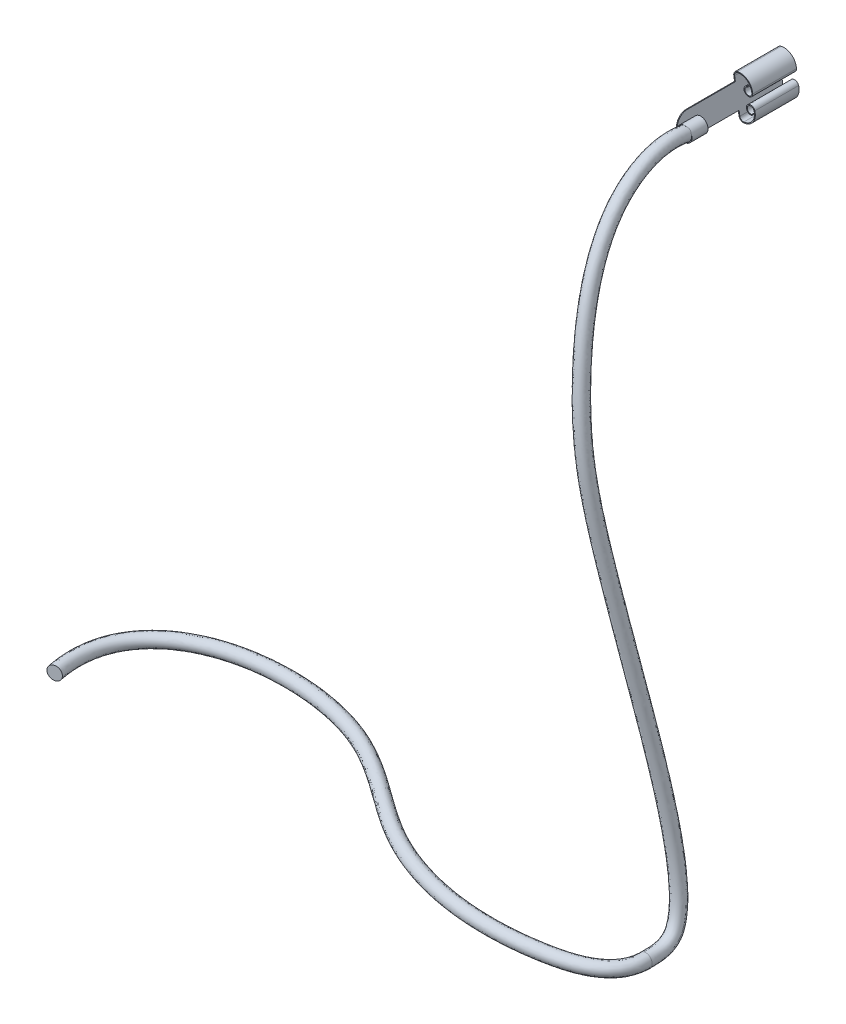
ISO-10303-21;
HEADER;
FILE_DESCRIPTION(('STEP AP214'),'2;1');
FILE_NAME('part.step','',(''),(''),'','','');
FILE_SCHEMA(('AUTOMOTIVE_DESIGN { 1 0 10303 214 1 1 1 1 }'));
ENDSEC;
DATA;
#1=APPLICATION_CONTEXT('core data for automotive mechanical design processes');
#2=APPLICATION_PROTOCOL_DEFINITION('international standard','automotive_design',2000,#1);
#3=PRODUCT_CONTEXT('',#1,'mechanical');
#4=PRODUCT('Part','Part','',(#3));
#5=PRODUCT_RELATED_PRODUCT_CATEGORY('part','',(#4));
#6=PRODUCT_DEFINITION_FORMATION('','',#4);
#7=PRODUCT_DEFINITION_CONTEXT('part definition',#1,'design');
#8=PRODUCT_DEFINITION('design','',#6,#7);
#9=PRODUCT_DEFINITION_SHAPE('','',#8);
#10=(LENGTH_UNIT() NAMED_UNIT(*) SI_UNIT(.MILLI.,.METRE.));
#11=(NAMED_UNIT(*) PLANE_ANGLE_UNIT() SI_UNIT($,.RADIAN.));
#12=(NAMED_UNIT(*) SI_UNIT($,.STERADIAN.) SOLID_ANGLE_UNIT());
#13=UNCERTAINTY_MEASURE_WITH_UNIT(LENGTH_MEASURE(1.E-05),#10,'distance_accuracy_value','');
#14=(GEOMETRIC_REPRESENTATION_CONTEXT(3) GLOBAL_UNCERTAINTY_ASSIGNED_CONTEXT((#13)) GLOBAL_UNIT_ASSIGNED_CONTEXT((#10,
#11,#12)) REPRESENTATION_CONTEXT('',''));
#15=CARTESIAN_POINT('',(0.,0.,0.));
#16=DIRECTION('',(0.,0.,1.));
#17=DIRECTION('',(1.,0.,0.));
#18=AXIS2_PLACEMENT_3D('',#15,#16,#17);
#19=CARTESIAN_POINT('',(0.,0.,10.));
#20=DIRECTION('',(0.,0.,1.));
#21=DIRECTION('',(1.,0.,0.));
#22=AXIS2_PLACEMENT_3D('',#19,#20,#21);
#23=CYLINDRICAL_SURFACE('',#22,0.832533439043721);
#24=CARTESIAN_POINT('',(0.730423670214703,0.399491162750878,11.8349038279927));
#25=CARTESIAN_POINT('',(0.727831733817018,0.404231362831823,11.8295746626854));
#26=CARTESIAN_POINT('',(0.725067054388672,0.409175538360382,11.8245137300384));
#27=CARTESIAN_POINT('',(0.719228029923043,0.419352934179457,11.8149912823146));
#28=CARTESIAN_POINT('',(0.716156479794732,0.42458337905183,11.8105250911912));
#29=CARTESIAN_POINT('',(0.709696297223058,0.435295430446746,11.8021657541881));
#30=CARTESIAN_POINT('',(0.706307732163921,0.440776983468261,11.7982724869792));
#31=CARTESIAN_POINT('',(0.69920569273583,0.451960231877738,11.7910084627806));
#32=CARTESIAN_POINT('',(0.695489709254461,0.457663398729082,11.7876424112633));
#33=CARTESIAN_POINT('',(0.691635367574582,0.463413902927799,11.7845480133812));
#34=B_SPLINE_CURVE_WITH_KNOTS('',3,(#24,#25,#26,#27,#28,#29,#30,#31,#32,#33),.UNSPECIFIED.,.F.,
.F.,(4,2,2,2,4),(0.,0.0227540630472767,0.0453170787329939,0.0678753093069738,
0.0906246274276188),.UNSPECIFIED.);
#35=CARTESIAN_POINT('',(0.730423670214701,0.399491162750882,11.8349038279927));
#36=VERTEX_POINT('',#35);
#37=CARTESIAN_POINT('',(0.69163536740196,0.46341390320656,11.7845480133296));
#38=VERTEX_POINT('',#37);
#39=EDGE_CURVE('E219',#36,#38,#34,.T.);
#40=ORIENTED_EDGE('',*,*,#39,.F.);
#41=CARTESIAN_POINT('',(0.,0.,11.8349038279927));
#42=DIRECTION('',(0.,0.,1.));
#43=DIRECTION('',(1.,0.,0.));
#44=AXIS2_PLACEMENT_3D('',#41,#42,#43);
#45=CIRCLE('',#44,0.832533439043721);
#46=CARTESIAN_POINT('',(0.156847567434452,0.817625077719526,11.8349038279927));
#47=VERTEX_POINT('',#46);
#48=EDGE_CURVE('E241',#47,#36,#45,.T.);
#49=ORIENTED_EDGE('',*,*,#48,.F.);
#50=CARTESIAN_POINT('',(0.529263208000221,0.642644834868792,11.7496884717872));
#51=CARTESIAN_POINT('',(0.513046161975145,0.656005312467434,11.7505281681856));
#52=CARTESIAN_POINT('',(0.496346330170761,0.668723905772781,11.7519937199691));
#53=CARTESIAN_POINT('',(0.462134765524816,0.692805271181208,11.7560286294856));
#54=CARTESIAN_POINT('',(0.444623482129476,0.704168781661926,11.758597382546));
#55=CARTESIAN_POINT('',(0.4093337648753,0.725238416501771,11.7646221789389));
#56=CARTESIAN_POINT('',(0.391570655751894,0.73497656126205,11.7680565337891));
#57=CARTESIAN_POINT('',(0.355535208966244,0.753069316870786,11.7757725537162));
#58=CARTESIAN_POINT('',(0.337262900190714,0.761424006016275,11.780054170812));
#59=CARTESIAN_POINT('',(0.292530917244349,0.779964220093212,11.791404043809));
#60=CARTESIAN_POINT('',(0.265875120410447,0.789430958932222,11.7988852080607));
#61=CARTESIAN_POINT('',(0.211754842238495,0.80566080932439,11.8155896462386));
#62=CARTESIAN_POINT('',(0.18428429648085,0.812375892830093,11.8248400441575));
#63=CARTESIAN_POINT('',(0.156847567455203,0.817625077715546,11.8349038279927));
#64=B_SPLINE_CURVE_WITH_KNOTS('',3,(#50,#51,#52,#53,#54,#55,#56,#57,#58,#59,#60,#61,#62,#63),
.UNSPECIFIED.,.F.,.F.,(4,2,2,2,2,2,4),(0.,0.0630459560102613,0.126057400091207,
0.187624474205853,0.249188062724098,0.336773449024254,0.425828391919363),.UNSPECIFIED.);
#65=CARTESIAN_POINT('',(0.529263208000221,0.642644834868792,11.7496884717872));
#66=VERTEX_POINT('',#65);
#67=EDGE_CURVE('E137',#66,#47,#64,.T.);
#68=ORIENTED_EDGE('',*,*,#67,.F.);
#69=CARTESIAN_POINT('',(0.0578406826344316,-0.673823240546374,11.9605097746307));
#70=CARTESIAN_POINT('',(1.55730254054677,-0.667094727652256,12.0001186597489));
#71=CARTESIAN_POINT('',(1.55730254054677,0.811719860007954,11.7489067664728));
#72=CARTESIAN_POINT('',(0.0578406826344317,0.804991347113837,11.7092978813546));
#73=CARTESIAN_POINT('',(-1.44162117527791,0.79826283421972,11.6696889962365));
#74=CARTESIAN_POINT('',(-1.44162117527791,-0.680551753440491,11.9209008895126));
#75=CARTESIAN_POINT('',(0.0578406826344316,-0.673823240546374,11.9605097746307));
#76=(BOUNDED_CURVE() B_SPLINE_CURVE(3,(#69,#70,#71,#72,#73,#74,#75),.UNSPECIFIED.,.T.,
.F.) B_SPLINE_CURVE_WITH_KNOTS((4,3,4),(0.,0.5,1.),
.UNSPECIFIED.) CURVE() GEOMETRIC_REPRESENTATION_ITEM() RATIONAL_B_SPLINE_CURVE((1.,
0.333333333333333,0.333333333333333,1.,0.333333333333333,0.333333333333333,1.)) REPRESENTATION_ITEM(''));
#77=EDGE_CURVE('E229',#38,#66,#76,.T.);
#78=ORIENTED_EDGE('',*,*,#77,.F.);
#79=EDGE_LOOP('',(#40,#49,#68,#78));
#80=FACE_BOUND('',#79,.T.);
#81=CARTESIAN_POINT('',(0.,0.,10.));
#82=DIRECTION('',(0.,0.,1.));
#83=DIRECTION('',(1.,0.,0.));
#84=AXIS2_PLACEMENT_3D('',#81,#82,#83);
#85=CIRCLE('',#84,0.832533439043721);
#86=CARTESIAN_POINT('',(0.832533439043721,0.,10.));
#87=VERTEX_POINT('',#86);
#88=EDGE_CURVE('E205',#87,#87,#85,.T.);
#89=ORIENTED_EDGE('',*,*,#88,.T.);
#90=EDGE_LOOP('',(#89));
#91=FACE_BOUND('',#90,.T.);
#92=ADVANCED_FACE('F79',(#80,#91),#23,.T.);
#93=CARTESIAN_POINT('',(0.,0.,10.));
#94=DIRECTION('',(0.,0.,1.));
#95=DIRECTION('',(1.,0.,0.));
#96=AXIS2_PLACEMENT_3D('',#93,#94,#95);
#97=PLANE('',#96);
#98=CARTESIAN_POINT('',(0.,0.,10.));
#99=DIRECTION('',(0.,0.,1.));
#100=DIRECTION('',(1.,0.,0.));
#101=AXIS2_PLACEMENT_3D('',#98,#99,#100);
#102=CIRCLE('',#101,0.65);
#103=CARTESIAN_POINT('',(0.65,0.,10.));
#104=VERTEX_POINT('',#103);
#105=EDGE_CURVE('E243',#104,#104,#102,.T.);
#106=ORIENTED_EDGE('',*,*,#105,.T.);
#107=EDGE_LOOP('',(#106));
#108=FACE_BOUND('',#107,.T.);
#109=ORIENTED_EDGE('',*,*,#88,.F.);
#110=EDGE_LOOP('',(#109));
#111=FACE_BOUND('',#110,.T.);
#112=ADVANCED_FACE('F251',(#108,#111),#97,.F.);
#113=CARTESIAN_POINT('',(0.,0.,10.));
#114=DIRECTION('',(0.,0.,1.));
#115=DIRECTION('',(1.,0.,0.));
#116=AXIS2_PLACEMENT_3D('',#113,#114,#115);
#117=CYLINDRICAL_SURFACE('',#116,0.65);
#118=ORIENTED_EDGE('',*,*,#105,.F.);
#119=EDGE_LOOP('',(#118));
#120=FACE_BOUND('',#119,.T.);
#121=CARTESIAN_POINT('',(0.,0.,11.8349038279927));
#122=DIRECTION('',(0.,0.,1.));
#123=DIRECTION('',(1.,0.,0.));
#124=AXIS2_PLACEMENT_3D('',#121,#122,#123);
#125=CIRCLE('',#124,0.65);
#126=CARTESIAN_POINT('',(-0.648270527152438,-0.0473848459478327,11.8349038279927));
#127=VERTEX_POINT('',#126);
#128=CARTESIAN_POINT('',(0.630696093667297,0.157233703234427,11.8349038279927));
#129=VERTEX_POINT('',#128);
#130=EDGE_CURVE('E233',#127,#129,#125,.T.);
#131=ORIENTED_EDGE('',*,*,#130,.T.);
#132=CARTESIAN_POINT('',(0.,0.,11.8444728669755));
#133=DIRECTION('',(0.0267842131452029,-0.167414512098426,-0.985522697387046));
#134=DIRECTION('',(0.155691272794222,-0.973147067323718,0.169543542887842));
#135=AXIS2_PLACEMENT_3D('',#132,#133,#134);
#136=ELLIPSE('',#135,0.659548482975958,0.65);
#137=EDGE_CURVE('E223',#129,#127,#136,.F.);
#138=ORIENTED_EDGE('',*,*,#137,.T.);
#139=EDGE_LOOP('',(#131,#138));
#140=FACE_BOUND('',#139,.T.);
#141=ADVANCED_FACE('F196',(#120,#140),#117,.F.);
#142=CARTESIAN_POINT('',(0.,0.,11.8349038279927));
#143=DIRECTION('',(0.,0.,1.));
#144=DIRECTION('',(1.,0.,0.));
#145=AXIS2_PLACEMENT_3D('',#142,#143,#144);
#146=PLANE('',#145);
#147=DIRECTION('',(0.987442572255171,0.157978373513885,0.));
#148=VECTOR('',#147,1.);
#149=CARTESIAN_POINT('',(-0.00878721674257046,0.0549244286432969,11.8349038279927));
#150=LINE('',#149,#148);
#151=CARTESIAN_POINT('',(0.798422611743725,0.184067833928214,11.8349038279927));
#152=VERTEX_POINT('',#151);
#153=EDGE_CURVE('E149',#129,#152,#150,.T.);
#154=ORIENTED_EDGE('',*,*,#153,.F.);
#155=ORIENTED_EDGE('',*,*,#130,.F.);
#156=CARTESIAN_POINT('',(-0.682741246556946,-0.052899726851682,11.8349038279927));
#157=VERTEX_POINT('',#156);
#158=EDGE_CURVE('E153',#157,#127,#150,.T.);
#159=ORIENTED_EDGE('',*,*,#158,.F.);
#160=CARTESIAN_POINT('',(0.798422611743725,0.184067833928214,11.8349038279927));
#161=CARTESIAN_POINT('',(0.79164201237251,0.226670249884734,11.8349038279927));
#162=CARTESIAN_POINT('',(0.781225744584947,0.268686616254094,11.8349038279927));
#163=CARTESIAN_POINT('',(0.753539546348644,0.350386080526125,11.8349038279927));
#164=CARTESIAN_POINT('',(0.736271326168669,0.390069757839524,11.8349038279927));
#165=CARTESIAN_POINT('',(0.69528075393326,0.465991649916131,11.8349038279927));
#166=CARTESIAN_POINT('',(0.671553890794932,0.502227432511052,11.8349038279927));
#167=CARTESIAN_POINT('',(0.618314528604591,0.570147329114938,11.8349038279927));
#168=CARTESIAN_POINT('',(0.588804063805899,0.601833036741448,11.8349038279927));
#169=CARTESIAN_POINT('',(0.525074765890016,0.659478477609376,11.8349038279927));
#170=CARTESIAN_POINT('',(0.49089614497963,0.68548265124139,11.8349038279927));
#171=CARTESIAN_POINT('',(0.418616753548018,0.731302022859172,11.8349038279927));
#172=CARTESIAN_POINT('',(0.380516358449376,0.751117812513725,11.8349038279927));
#173=CARTESIAN_POINT('',(0.301954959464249,0.783757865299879,11.8349038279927));
#174=CARTESIAN_POINT('',(0.261526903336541,0.796661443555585,11.8349038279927));
#175=CARTESIAN_POINT('',(0.179071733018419,0.815430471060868,11.8349038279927));
#176=CARTESIAN_POINT('',(0.137044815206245,0.821296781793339,11.8349038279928));
#177=CARTESIAN_POINT('',(0.0529745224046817,0.825786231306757,11.8349038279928));
#178=CARTESIAN_POINT('',(0.0109344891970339,0.824472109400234,11.8349038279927));
#179=CARTESIAN_POINT('',(-0.0723229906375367,0.814776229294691,11.8349038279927));
#180=CARTESIAN_POINT('',(-0.113540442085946,0.806394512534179,11.8349038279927));
#181=CARTESIAN_POINT('',(-0.193822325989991,0.782850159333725,11.8349038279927));
#182=CARTESIAN_POINT('',(-0.232894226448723,0.767712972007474,11.8349038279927));
#183=CARTESIAN_POINT('',(-0.307947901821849,0.731105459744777,11.8349038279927));
#184=CARTESIAN_POINT('',(-0.343929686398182,0.709635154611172,11.8349038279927));
#185=CARTESIAN_POINT('',(-0.411864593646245,0.660938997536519,11.8349038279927));
#186=CARTESIAN_POINT('',(-0.443809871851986,0.633702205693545,11.8349038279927));
#187=CARTESIAN_POINT('',(-0.502711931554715,0.574287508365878,11.8349038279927));
#188=CARTESIAN_POINT('',(-0.529668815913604,0.542109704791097,11.8349038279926));
#189=CARTESIAN_POINT('',(-0.578046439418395,0.473486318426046,11.8349038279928));
#190=CARTESIAN_POINT('',(-0.599426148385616,0.437011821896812,11.8349038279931));
#191=CARTESIAN_POINT('',(-0.635833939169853,0.361018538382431,11.8349038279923));
#192=CARTESIAN_POINT('',(-0.650861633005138,0.321499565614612,11.8349038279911));
#193=CARTESIAN_POINT('',(-0.674327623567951,0.240058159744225,11.8349038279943));
#194=CARTESIAN_POINT('',(-0.682686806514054,0.198113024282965,11.8349038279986));
#195=CARTESIAN_POINT('',(-0.692316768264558,0.113450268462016,11.8349038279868));
#196=CARTESIAN_POINT('',(-0.693597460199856,0.070733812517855,11.8349038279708));
#197=CARTESIAN_POINT('',(-0.690636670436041,0.0146539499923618,11.8349038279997));
#198=CARTESIAN_POINT('',(-0.689556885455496,0.00107352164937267,11.8349038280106));
#199=CARTESIAN_POINT('',(-0.68668252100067,-0.0259881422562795,11.8349038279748));
#200=CARTESIAN_POINT('',(-0.684889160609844,-0.0394695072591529,11.8349038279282));
#201=CARTESIAN_POINT('',(-0.68274124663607,-0.0528997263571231,11.8349038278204));
#202=B_SPLINE_CURVE_WITH_KNOTS('',3,(#160,#161,#162,#163,#164,#165,#166,#167,#168,#169,#170,
#171,#172,#173,#174,#175,#176,#177,#178,#179,#180,#181,#182,#183,#184,#185,#186,#187,#188,#189,
#190,#191,#192,#193,#194,#195,#196,#197,#198,#199,#200,#201),.UNSPECIFIED.,.F.,.F.,(4,2,2,2,2,2,
2,2,2,2,2,2,2,2,2,2,2,2,2,2,4),(0.,0.129256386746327,0.258480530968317,0.387795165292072,
0.517064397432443,0.645283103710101,0.773489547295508,0.90019151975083,1.02687798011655,
1.15245929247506,1.27803986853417,1.40315130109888,1.52826234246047,1.65361290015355,
1.77896087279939,1.90520653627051,2.0314599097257,2.15918973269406,2.28674062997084,
2.32759704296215,2.3683839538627),.UNSPECIFIED.);
#203=EDGE_CURVE('E199',#47,#157,#202,.T.);
#204=ORIENTED_EDGE('',*,*,#203,.F.);
#205=ORIENTED_EDGE('',*,*,#48,.T.);
#206=EDGE_CURVE('E151',#152,#36,#202,.T.);
#207=ORIENTED_EDGE('',*,*,#206,.F.);
#208=EDGE_LOOP('',(#154,#155,#159,#204,#205,#207));
#209=FACE_BOUND('',#208,.T.);
#210=ADVANCED_FACE('F192',(#209),#146,.T.);
#211=CARTESIAN_POINT('',(0.0578406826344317,0.804991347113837,11.7092978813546));
#212=DIRECTION('',(0.0267842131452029,-0.167414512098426,-0.985522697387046));
#213=DIRECTION('',(0.,0.985876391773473,-0.1674745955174));
#214=AXIS2_PLACEMENT_3D('',#211,#212,#213);
#215=PLANE('',#214);
#216=CARTESIAN_POINT('',(0.0578406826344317,0.0655840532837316,11.8349038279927));
#217=DIRECTION('',(-0.0267842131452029,0.167414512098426,0.985522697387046));
#218=DIRECTION('',(0.,-0.985876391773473,0.1674745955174));
#219=AXIS2_PLACEMENT_3D('',#216,#217,#218);
#220=CIRCLE('',#219,0.75);
#221=EDGE_CURVE('E138',#157,#152,#220,.T.);
#222=ORIENTED_EDGE('',*,*,#221,.F.);
#223=ORIENTED_EDGE('',*,*,#158,.T.);
#224=ORIENTED_EDGE('',*,*,#137,.F.);
#225=ORIENTED_EDGE('',*,*,#153,.T.);
#226=EDGE_LOOP('',(#222,#223,#224,#225));
#227=FACE_BOUND('',#226,.T.);
#228=ADVANCED_FACE('F191',(#227),#215,.T.);
#229=CARTESIAN_POINT('',(11.0130944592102,-67.6707356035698,27.3303592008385));
#230=DIRECTION('',(-8.69698563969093E-05,0.000543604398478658,-0.99999984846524));
#231=DIRECTION('',(0.,0.999999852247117,0.000543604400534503));
#232=AXIS2_PLACEMENT_3D('',#229,#230,#231);
#233=PLANE('',#232);
#234=CARTESIAN_POINT('',(11.014788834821,-68.4207335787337,27.3299513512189));
#235=DIRECTION('',(-8.69698563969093E-05,0.000543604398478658,-0.99999984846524));
#236=DIRECTION('',(0.,0.999999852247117,0.000543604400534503));
#237=AXIS2_PLACEMENT_3D('',#234,#235,#236);
#238=CIRCLE('',#237,0.749999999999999);
#239=CARTESIAN_POINT('',(11.0580794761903,-67.671984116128,27.3303546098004));
#240=VERTEX_POINT('',#239);
#241=CARTESIAN_POINT('',(10.7123613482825,-67.7344118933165,27.3303507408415));
#242=VERTEX_POINT('',#241);
#243=EDGE_CURVE('E134',#240,#242,#238,.T.);
#244=ORIENTED_EDGE('',*,*,#243,.F.);
#245=DIRECTION('',(-0.0285660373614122,-0.999591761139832,-0.000540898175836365));
#246=VECTOR('',#245,1.);
#247=CARTESIAN_POINT('',(11.0580784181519,-67.6720211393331,27.3303545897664));
#248=LINE('',#247,#246);
#249=CARTESIAN_POINT('',(11.0158751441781,-69.1488111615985,27.3295554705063));
#250=VERTEX_POINT('',#249);
#251=EDGE_CURVE('E99',#240,#250,#248,.T.);
#252=ORIENTED_EDGE('',*,*,#251,.T.);
#253=CARTESIAN_POINT('',(11.0158751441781,-69.1488111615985,27.3295554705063));
#254=CARTESIAN_POINT('',(10.9737424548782,-69.1464723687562,27.329560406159));
#255=CARTESIAN_POINT('',(10.9318245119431,-69.1405102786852,27.3295672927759));
#256=CARTESIAN_POINT('',(10.849603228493,-69.1216697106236,27.3295846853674));
#257=CARTESIAN_POINT('',(10.8092987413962,-69.1087962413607,27.329595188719));
#258=CARTESIAN_POINT('',(10.7314068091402,-69.0764511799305,27.3296195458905));
#259=CARTESIAN_POINT('',(10.6938206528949,-69.0569764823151,27.3296334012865));
#260=CARTESIAN_POINT('',(10.6224588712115,-69.0119984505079,27.329664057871));
#261=CARTESIAN_POINT('',(10.5886824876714,-68.9864963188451,27.3296808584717));
#262=CARTESIAN_POINT('',(10.5258937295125,-68.9301841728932,27.3297169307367));
#263=CARTESIAN_POINT('',(10.4968810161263,-68.8993745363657,27.3297362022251));
#264=CARTESIAN_POINT('',(10.4444401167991,-68.8333216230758,27.3297766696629));
#265=CARTESIAN_POINT('',(10.4210119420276,-68.7980783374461,27.3297978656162));
#266=CARTESIAN_POINT('',(10.3804054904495,-68.7241595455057,27.3298415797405));
#267=CARTESIAN_POINT('',(10.3632270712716,-68.6854841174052,27.3298640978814));
#268=CARTESIAN_POINT('',(10.3356072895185,-68.6058007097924,27.3299098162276));
#269=CARTESIAN_POINT('',(10.3251655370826,-68.56479286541,27.3299330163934));
#270=CARTESIAN_POINT('',(10.3113124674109,-68.4816006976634,27.3299794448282));
#271=CARTESIAN_POINT('',(10.3079020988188,-68.4394162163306,27.3300026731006));
#272=CARTESIAN_POINT('',(10.3082112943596,-68.3550729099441,27.3300484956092));
#273=CARTESIAN_POINT('',(10.3119309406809,-68.3129140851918,27.3300710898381));
#274=CARTESIAN_POINT('',(10.3263954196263,-68.229816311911,27.3301150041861));
#275=CARTESIAN_POINT('',(10.3371407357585,-68.1888774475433,27.3301363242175));
#276=CARTESIAN_POINT('',(10.3653525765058,-68.1093848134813,27.3301770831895));
#277=CARTESIAN_POINT('',(10.3828191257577,-68.0708310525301,27.3301965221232));
#278=CARTESIAN_POINT('',(10.4239761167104,-67.9972064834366,27.3302329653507));
#279=CARTESIAN_POINT('',(10.4476661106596,-67.9621354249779,27.3302499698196));
#280=CARTESIAN_POINT('',(10.5005991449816,-67.8964693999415,27.3302810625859));
#281=CARTESIAN_POINT('',(10.5298420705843,-67.8658743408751,27.3302951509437));
#282=CARTESIAN_POINT('',(10.5930515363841,-67.8100246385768,27.3303200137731));
#283=CARTESIAN_POINT('',(10.6270189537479,-67.7847709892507,27.3303307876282));
#284=CARTESIAN_POINT('',(10.6987066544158,-67.7403357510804,27.3303487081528));
#285=CARTESIAN_POINT('',(10.7364246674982,-67.7211505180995,27.3303558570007));
#286=CARTESIAN_POINT('',(10.7997068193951,-67.6954088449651,27.3303643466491));
#287=CARTESIAN_POINT('',(10.824465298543,-67.686821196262,27.3303668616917));
#288=CARTESIAN_POINT('',(10.8747026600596,-67.6722871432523,27.3303703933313));
#289=CARTESIAN_POINT('',(10.9001803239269,-67.6663365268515,27.3303714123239));
#290=CARTESIAN_POINT('',(10.9259114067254,-67.66173369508,27.3303716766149));
#291=B_SPLINE_CURVE_WITH_KNOTS('',3,(#253,#254,#255,#256,#257,#258,#259,#260,#261,#262,#263,
#264,#265,#266,#267,#268,#269,#270,#271,#272,#273,#274,#275,#276,#277,#278,#279,#280,#281,#282,
#283,#284,#285,#286,#287,#288,#289,#290),.UNSPECIFIED.,.F.,.F.,(4,2,2,2,2,2,2,2,2,2,2,2,2,2,2,2,
2,2,4),(0.,0.126424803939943,0.25275811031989,0.379150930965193,0.50551855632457,
0.631877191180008,0.758236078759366,0.884592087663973,1.01094078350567,1.13730652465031,
1.26367372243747,1.39004961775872,1.5164259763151,1.64279324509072,1.76915790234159,
1.89554605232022,2.02185816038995,2.10034316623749,2.17870235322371),.UNSPECIFIED.);
#292=EDGE_CURVE('E140',#250,#242,#291,.T.);
#293=ORIENTED_EDGE('',*,*,#292,.T.);
#294=EDGE_LOOP('',(#244,#252,#293));
#295=FACE_BOUND('',#294,.T.);
#296=ADVANCED_FACE('F141',(#295),#233,.F.);
#297=CARTESIAN_POINT('',(0.0578406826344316,-0.673823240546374,11.9605097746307));
#298=CARTESIAN_POINT('',(0.0403075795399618,-0.564232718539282,12.5759260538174));
#299=CARTESIAN_POINT('',(0.0341873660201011,-0.525978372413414,13.8117126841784));
#300=CARTESIAN_POINT('',(0.0919815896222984,-0.887220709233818,15.6470042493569));
#301=CARTESIAN_POINT('',(0.209723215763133,-1.62316381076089,17.3819862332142));
#302=CARTESIAN_POINT('',(0.322083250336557,-2.32546931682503,18.453651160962));
#303=CARTESIAN_POINT('',(0.511118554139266,-3.50703298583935,19.9572163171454));
#304=CARTESIAN_POINT('',(0.821166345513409,-5.44498424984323,21.6959894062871));
#305=CARTESIAN_POINT('',(1.58228721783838,-10.2023642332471,24.1944644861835));
#306=CARTESIAN_POINT('',(2.23746952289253,-14.2975760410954,25.1801747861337));
#307=CARTESIAN_POINT('',(3.01262021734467,-19.1426493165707,26.0262220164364));
#308=CARTESIAN_POINT('',(3.58133152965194,-22.6973748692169,26.3385958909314));
#309=CARTESIAN_POINT('',(4.52644281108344,-28.6047854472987,25.9530540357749));
#310=CARTESIAN_POINT('',(5.60146793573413,-35.3242214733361,25.0830652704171));
#311=CARTESIAN_POINT('',(6.60787772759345,-41.6147779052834,24.1554347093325));
#312=CARTESIAN_POINT('',(7.57562191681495,-47.6636552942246,23.2799341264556));
#313=CARTESIAN_POINT('',(8.39975909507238,-52.8149181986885,22.5415589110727));
#314=CARTESIAN_POINT('',(9.37812273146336,-58.9301723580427,21.970017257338));
#315=CARTESIAN_POINT('',(10.0317817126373,-63.0158626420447,21.9867828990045));
#316=CARTESIAN_POINT('',(10.3439773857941,-64.967239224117,22.2023998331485));
#317=CARTESIAN_POINT('',(10.5431647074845,-66.2122580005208,22.5065775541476));
#318=CARTESIAN_POINT('',(10.6616445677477,-66.9528154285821,22.771195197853));
#319=CARTESIAN_POINT('',(10.7516615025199,-67.5154655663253,23.064512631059));
#320=CARTESIAN_POINT('',(10.8138670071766,-67.9042805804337,23.3481043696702));
#321=CARTESIAN_POINT('',(10.8892308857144,-68.3753419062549,23.7776278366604));
#322=CARTESIAN_POINT('',(10.9642394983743,-68.8441826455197,24.5007061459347));
#323=CARTESIAN_POINT('',(11.0067724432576,-69.1100344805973,25.5115035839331));
#324=CARTESIAN_POINT('',(11.0174585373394,-69.1768278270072,26.482340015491));
#325=CARTESIAN_POINT('',(11.0164834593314,-69.1707331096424,27.0552162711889));
#326=CARTESIAN_POINT('',(11.0164832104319,-69.1707315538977,27.3295435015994));
#327=CARTESIAN_POINT('',(1.55730254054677,-0.667094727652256,12.0001186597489));
#328=CARTESIAN_POINT('',(1.5400584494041,-0.559310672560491,12.5955311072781));
#329=CARTESIAN_POINT('',(1.53451625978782,-0.524669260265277,13.791310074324));
#330=CARTESIAN_POINT('',(1.59045725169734,-0.87432798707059,15.575754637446));
#331=CARTESIAN_POINT('',(1.70542187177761,-1.59291343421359,17.2697810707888));
#332=CARTESIAN_POINT('',(1.81532302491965,-2.27984972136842,18.3182794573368));
#333=CARTESIAN_POINT('',(2.00046647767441,-3.43708740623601,19.7909345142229));
#334=CARTESIAN_POINT('',(2.3047469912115,-5.33899034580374,21.4986866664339));
#335=CARTESIAN_POINT('',(3.05696491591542,-10.0407225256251,23.9703997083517));
#336=CARTESIAN_POINT('',(3.70901989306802,-14.1163869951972,24.9519502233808));
#337=CARTESIAN_POINT('',(4.4797462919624,-18.9338062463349,25.7939422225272));
#338=CARTESIAN_POINT('',(5.04449132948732,-22.4637406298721,26.1040445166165));
#339=CARTESIAN_POINT('',(5.98541468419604,-28.3449746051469,25.7207658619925));
#340=CARTESIAN_POINT('',(7.05939012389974,-35.057849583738,24.8517603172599));
#341=CARTESIAN_POINT('',(8.06555910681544,-41.3469008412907,23.9243188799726));
#342=CARTESIAN_POINT('',(9.03361078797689,-47.3977002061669,23.048562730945));
#343=CARTESIAN_POINT('',(9.85824317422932,-52.5520584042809,22.309780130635));
#344=CARTESIAN_POINT('',(10.8387839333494,-58.6809206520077,21.7364443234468));
#345=CARTESIAN_POINT('',(11.4964655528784,-62.7917544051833,21.753070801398));
#346=CARTESIAN_POINT('',(11.8125550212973,-64.7674691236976,21.9705889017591));
#347=CARTESIAN_POINT('',(12.0165037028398,-66.0422487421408,22.2817192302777));
#348=CARTESIAN_POINT('',(12.1391041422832,-66.8085618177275,22.5552977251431));
#349=CARTESIAN_POINT('',(12.2336344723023,-67.3994228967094,22.8626187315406));
#350=CARTESIAN_POINT('',(12.3000611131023,-67.8146220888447,23.1654370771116));
#351=CARTESIAN_POINT('',(12.3810253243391,-68.3206882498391,23.6265422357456));
#352=CARTESIAN_POINT('',(12.461860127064,-68.8259455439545,24.4069683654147));
#353=CARTESIAN_POINT('',(12.5065676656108,-69.1053896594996,25.4765536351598));
#354=CARTESIAN_POINT('',(12.5174773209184,-69.173580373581,26.4800400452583));
#355=CARTESIAN_POINT('',(12.5164871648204,-69.1673914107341,27.0543638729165));
#356=CARTESIAN_POINT('',(12.5164793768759,-69.1673427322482,27.329414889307));
#357=CARTESIAN_POINT('',(1.55730254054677,0.811719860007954,11.7489067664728));
#358=CARTESIAN_POINT('',(1.5382254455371,0.930961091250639,12.4711897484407));
#359=CARTESIAN_POINT('',(1.52901724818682,0.988516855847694,13.9207097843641));
#360=CARTESIAN_POINT('',(1.59671201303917,0.565391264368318,16.027641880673));
#361=CARTESIAN_POINT('',(1.7292892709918,-0.263281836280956,17.9814211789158));
#362=CARTESIAN_POINT('',(1.8547854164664,-1.04769449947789,19.1768489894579));
#363=CARTESIAN_POINT('',(2.06461220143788,-2.35921515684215,20.8455455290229));
#364=CARTESIAN_POINT('',(2.40547058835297,-4.48974780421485,22.7500421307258));
#365=CARTESIAN_POINT('',(3.21415378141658,-9.54441569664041,25.3914883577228));
#366=CARTESIAN_POINT('',(3.8860432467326,-13.7440554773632,26.3994215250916));
#367=CARTESIAN_POINT('',(4.68482990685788,-18.736865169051,27.2671330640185));
#368=CARTESIAN_POINT('',(5.27473029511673,-22.4240328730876,27.5916424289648));
#369=CARTESIAN_POINT('',(6.24221478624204,-28.4712870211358,27.1940098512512));
#370=CARTESIAN_POINT('',(7.3228476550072,-35.22577420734,26.3187684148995));
#371=CARTESIAN_POINT('',(8.33054392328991,-41.5243717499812,25.39012749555));
#372=CARTESIAN_POINT('',(9.29664539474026,-47.5629813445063,24.5159922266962));
#373=CARTESIAN_POINT('',(10.11813701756,-52.6977082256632,23.7797933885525));
#374=CARTESIAN_POINT('',(11.0848697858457,-58.740263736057,23.2178366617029));
#375=CARTESIAN_POINT('',(11.7170385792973,-62.6916297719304,23.2353457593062));
#376=CARTESIAN_POINT('',(12.0084323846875,-64.5129844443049,23.440806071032));
#377=CARTESIAN_POINT('',(12.1821830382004,-65.5990115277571,23.7078407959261));
#378=CARTESIAN_POINT('',(12.2786494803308,-66.201974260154,23.9245867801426));
#379=CARTESIAN_POINT('',(12.3445544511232,-66.6139127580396,24.1430927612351));
#380=CARTESIAN_POINT('',(12.3842093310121,-66.8617752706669,24.3239699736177));
#381=CARTESIAN_POINT('',(12.4296544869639,-67.1458298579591,24.5847742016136));
#382=CARTESIAN_POINT('',(12.4735377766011,-67.4201220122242,25.0014825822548));
#383=CARTESIAN_POINT('',(12.5044533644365,-67.6133596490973,25.6982171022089));
#384=CARTESIAN_POINT('',(12.513945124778,-67.672687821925,26.494627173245));
#385=CARTESIAN_POINT('',(12.5130505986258,-67.6670965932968,27.0597700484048));
#386=CARTESIAN_POINT('',(12.5130906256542,-67.6673467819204,27.3302305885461));
#387=CARTESIAN_POINT('',(0.0578406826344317,0.804991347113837,11.7092978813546));
#388=CARTESIAN_POINT('',(0.0384745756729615,0.926039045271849,12.45158469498));
#389=CARTESIAN_POINT('',(0.0286883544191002,0.987207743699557,13.9411123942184));
#390=CARTESIAN_POINT('',(0.0982363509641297,0.552498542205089,16.0988914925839));
#391=CARTESIAN_POINT('',(0.233590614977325,-0.293532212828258,18.0936263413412));
#392=CARTESIAN_POINT('',(0.361545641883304,-1.0933140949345,19.3122206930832));
#393=CARTESIAN_POINT('',(0.575264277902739,-2.42916073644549,21.0118273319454));
#394=CARTESIAN_POINT('',(0.92188994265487,-4.59574170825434,22.9473448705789));
#395=CARTESIAN_POINT('',(1.73947608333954,-9.70605740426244,25.6155531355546));
#396=CARTESIAN_POINT('',(2.41449287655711,-13.9252445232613,26.6276460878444));
#397=CARTESIAN_POINT('',(3.21770383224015,-18.9457082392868,27.4994128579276));
#398=CARTESIAN_POINT('',(3.81157049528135,-22.6576671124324,27.8261938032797));
#399=CARTESIAN_POINT('',(4.78324291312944,-28.7310978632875,27.4262980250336));
#400=CARTESIAN_POINT('',(5.86492546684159,-35.4921460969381,26.5500733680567));
#401=CARTESIAN_POINT('',(6.87286254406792,-41.7922488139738,25.6212433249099));
#402=CARTESIAN_POINT('',(7.83865652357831,-47.828936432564,24.7473636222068));
#403=CARTESIAN_POINT('',(8.65965293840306,-52.9605680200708,24.0115721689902));
#404=CARTESIAN_POINT('',(9.62420858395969,-58.9895154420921,23.4514095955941));
#405=CARTESIAN_POINT('',(10.2523547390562,-62.9157380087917,23.4690578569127));
#406=CARTESIAN_POINT('',(10.5398547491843,-64.7127545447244,23.6726170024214));
#407=CARTESIAN_POINT('',(10.7088440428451,-65.7690207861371,23.932699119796));
#408=CARTESIAN_POINT('',(10.8011899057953,-66.3462278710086,24.1404842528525));
#409=CARTESIAN_POINT('',(10.8625814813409,-66.7299554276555,24.3449866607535));
#410=CARTESIAN_POINT('',(10.8980152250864,-66.9514337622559,24.5066372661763));
#411=CARTESIAN_POINT('',(10.9378600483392,-67.2004835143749,24.7358598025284));
#412=CARTESIAN_POINT('',(10.9759171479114,-67.4383591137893,25.0952203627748));
#413=CARTESIAN_POINT('',(11.0046581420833,-67.618004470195,25.7331670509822));
#414=CARTESIAN_POINT('',(11.013926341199,-67.6759352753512,26.4969271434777));
#415=CARTESIAN_POINT('',(11.0130468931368,-67.6704382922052,27.0606224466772));
#416=CARTESIAN_POINT('',(11.0130944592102,-67.6707356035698,27.3303592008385));
#417=CARTESIAN_POINT('',(-1.44162117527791,0.79826283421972,11.6696889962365));
#418=CARTESIAN_POINT('',(-1.46127629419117,0.921116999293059,12.4319796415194));
#419=CARTESIAN_POINT('',(-1.47164053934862,0.985898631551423,13.9615150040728));
#420=CARTESIAN_POINT('',(-1.40023931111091,0.539605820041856,16.1701411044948));
#421=CARTESIAN_POINT('',(-1.26210804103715,-0.323782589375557,18.2058315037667));
#422=CARTESIAN_POINT('',(-1.13169413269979,-1.13893369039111,19.4475923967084));
#423=CARTESIAN_POINT('',(-0.914083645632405,-2.49910631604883,21.1781091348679));
#424=CARTESIAN_POINT('',(-0.561690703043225,-4.70173561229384,23.1446476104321));
#425=CARTESIAN_POINT('',(0.264798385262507,-9.86769911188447,25.8396179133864));
#426=CARTESIAN_POINT('',(0.942942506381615,-14.1064335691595,26.8558706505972));
#427=CARTESIAN_POINT('',(1.75057775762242,-19.1545513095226,27.7316926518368));
#428=CARTESIAN_POINT('',(2.34841069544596,-22.8913013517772,28.0607451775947));
#429=CARTESIAN_POINT('',(3.32427104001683,-28.9909087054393,27.658586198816));
#430=CARTESIAN_POINT('',(4.40700327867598,-35.7585179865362,26.781378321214));
#431=CARTESIAN_POINT('',(5.41518116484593,-42.0601258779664,25.8523591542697));
#432=CARTESIAN_POINT('',(6.38066765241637,-48.0948915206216,24.9787350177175));
#433=CARTESIAN_POINT('',(7.20116885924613,-53.2234278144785,24.2433509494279));
#434=CARTESIAN_POINT('',(8.16354738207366,-59.2387671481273,23.6849825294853));
#435=CARTESIAN_POINT('',(8.78767089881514,-63.139846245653,23.7027699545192));
#436=CARTESIAN_POINT('',(9.07127711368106,-64.9125246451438,23.9044279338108));
#437=CARTESIAN_POINT('',(9.23550504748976,-65.9390300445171,24.1575574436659));
#438=CARTESIAN_POINT('',(9.3237303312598,-66.4904814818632,24.3563817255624));
#439=CARTESIAN_POINT('',(9.3806085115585,-66.8459980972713,24.5468805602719));
#440=CARTESIAN_POINT('',(9.41182111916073,-67.0410922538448,24.689304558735));
#441=CARTESIAN_POINT('',(9.44606560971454,-67.2551371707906,24.8869454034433));
#442=CARTESIAN_POINT('',(9.47829651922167,-67.4565962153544,25.1889581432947));
#443=CARTESIAN_POINT('',(9.50486291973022,-67.6226492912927,25.7681169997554));
#444=CARTESIAN_POINT('',(9.51390755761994,-67.6791827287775,26.4992271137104));
#445=CARTESIAN_POINT('',(9.51304318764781,-67.6737799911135,27.0614748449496));
#446=CARTESIAN_POINT('',(9.51309829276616,-67.6741244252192,27.3304878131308));
#447=CARTESIAN_POINT('',(-1.44162117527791,-0.680551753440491,11.9209008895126));
#448=CARTESIAN_POINT('',(-1.45944329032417,-0.569154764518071,12.5563210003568));
#449=CARTESIAN_POINT('',(-1.46614152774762,-0.527287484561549,13.8321152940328));
#450=CARTESIAN_POINT('',(-1.40649407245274,-0.90011343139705,15.7182538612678));
#451=CARTESIAN_POINT('',(-1.28597544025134,-1.65341418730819,17.4941913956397));
#452=CARTESIAN_POINT('',(-1.17115652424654,-2.37108891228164,18.5890228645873));
#453=CARTESIAN_POINT('',(-0.978229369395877,-3.57697856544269,20.1234981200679));
#454=CARTESIAN_POINT('',(-0.662414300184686,-5.55097815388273,21.8932921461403));
#455=CARTESIAN_POINT('',(0.107609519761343,-10.3640059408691,24.4185292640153));
#456=CARTESIAN_POINT('',(0.765919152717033,-14.4787650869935,25.4083993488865));
#457=CARTESIAN_POINT('',(1.54549414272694,-19.3514923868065,26.2585018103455));
#458=CARTESIAN_POINT('',(2.11817172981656,-22.9310091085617,26.5731472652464));
#459=CARTESIAN_POINT('',(3.06747093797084,-28.8645962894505,26.1853422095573));
#460=CARTESIAN_POINT('',(4.14354574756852,-35.5905933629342,25.3143702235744));
#461=CARTESIAN_POINT('',(5.15019634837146,-41.882654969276,24.3865505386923));
#462=CARTESIAN_POINT('',(6.117633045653,-47.9296103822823,23.5113055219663));
#463=CARTESIAN_POINT('',(6.94127501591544,-53.0777779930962,22.7733376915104));
#464=CARTESIAN_POINT('',(7.91746152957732,-59.1794240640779,22.2035901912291));
#465=CARTESIAN_POINT('',(8.56709787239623,-63.2399708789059,22.220494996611));
#466=CARTESIAN_POINT('',(8.87539975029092,-65.1670093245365,22.4342107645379));
#467=CARTESIAN_POINT('',(9.06982571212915,-66.3822672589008,22.7314358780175));
#468=CARTESIAN_POINT('',(9.18418499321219,-67.0970690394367,22.9870926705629));
#469=CARTESIAN_POINT('',(9.26968853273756,-67.6315082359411,23.2664065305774));
#470=CARTESIAN_POINT('',(9.32767290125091,-67.9939390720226,23.5307716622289));
#471=CARTESIAN_POINT('',(9.39743644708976,-68.4299955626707,23.9287134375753));
#472=CARTESIAN_POINT('',(9.46661886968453,-68.8624197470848,24.5944439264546));
#473=CARTESIAN_POINT('',(9.50697722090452,-69.114679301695,25.5464535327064));
#474=CARTESIAN_POINT('',(9.51743975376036,-69.1800752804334,26.4846399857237));
#475=CARTESIAN_POINT('',(9.51647975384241,-69.1740748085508,27.0560686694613));
#476=CARTESIAN_POINT('',(9.51648704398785,-69.1741203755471,27.3296721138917));
#477=CARTESIAN_POINT('',(0.0578406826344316,-0.673823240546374,11.9605097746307));
#478=CARTESIAN_POINT('',(0.0403075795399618,-0.564232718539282,12.5759260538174));
#479=CARTESIAN_POINT('',(0.0341873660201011,-0.525978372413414,13.8117126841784));
#480=CARTESIAN_POINT('',(0.0919815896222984,-0.887220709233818,15.6470042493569));
#481=CARTESIAN_POINT('',(0.209723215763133,-1.62316381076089,17.3819862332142));
#482=CARTESIAN_POINT('',(0.322083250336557,-2.32546931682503,18.453651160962));
#483=CARTESIAN_POINT('',(0.511118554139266,-3.50703298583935,19.9572163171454));
#484=CARTESIAN_POINT('',(0.821166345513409,-5.44498424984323,21.6959894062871));
#485=CARTESIAN_POINT('',(1.58228721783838,-10.2023642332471,24.1944644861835));
#486=CARTESIAN_POINT('',(2.23746952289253,-14.2975760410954,25.1801747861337));
#487=CARTESIAN_POINT('',(3.01262021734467,-19.1426493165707,26.0262220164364));
#488=CARTESIAN_POINT('',(3.58133152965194,-22.6973748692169,26.3385958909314));
#489=CARTESIAN_POINT('',(4.52644281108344,-28.6047854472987,25.9530540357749));
#490=CARTESIAN_POINT('',(5.60146793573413,-35.3242214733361,25.0830652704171));
#491=CARTESIAN_POINT('',(6.60787772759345,-41.6147779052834,24.1554347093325));
#492=CARTESIAN_POINT('',(7.57562191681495,-47.6636552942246,23.2799341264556));
#493=CARTESIAN_POINT('',(8.39975909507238,-52.8149181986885,22.5415589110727));
#494=CARTESIAN_POINT('',(9.37812273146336,-58.9301723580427,21.970017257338));
#495=CARTESIAN_POINT('',(10.0317817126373,-63.0158626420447,21.9867828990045));
#496=CARTESIAN_POINT('',(10.3439773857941,-64.967239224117,22.2023998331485));
#497=CARTESIAN_POINT('',(10.5431647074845,-66.2122580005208,22.5065775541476));
#498=CARTESIAN_POINT('',(10.6616445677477,-66.9528154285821,22.771195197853));
#499=CARTESIAN_POINT('',(10.7516615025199,-67.5154655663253,23.064512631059));
#500=CARTESIAN_POINT('',(10.8138670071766,-67.9042805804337,23.3481043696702));
#501=CARTESIAN_POINT('',(10.8892308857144,-68.3753419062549,23.7776278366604));
#502=CARTESIAN_POINT('',(10.9642394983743,-68.8441826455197,24.5007061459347));
#503=CARTESIAN_POINT('',(11.0067724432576,-69.1100344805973,25.5115035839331));
#504=CARTESIAN_POINT('',(11.0174585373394,-69.1768278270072,26.482340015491));
#505=CARTESIAN_POINT('',(11.0164834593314,-69.1707331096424,27.0552162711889));
#506=CARTESIAN_POINT('',(11.0164832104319,-69.1707315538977,27.3295435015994));
#507=(BOUNDED_SURFACE() B_SPLINE_SURFACE(3,3,((#297,#298,#299,#300,#301,#302,#303,#304,#305,
#306,#307,#308,#309,#310,#311,#312,#313,#314,#315,#316,#317,#318,#319,#320,#321,#322,#323,#324,
#325,#326),(#327,#328,#329,#330,#331,#332,#333,#334,#335,#336,#337,#338,#339,#340,#341,#342,
#343,#344,#345,#346,#347,#348,#349,#350,#351,#352,#353,#354,#355,#356),(#357,#358,#359,#360,
#361,#362,#363,#364,#365,#366,#367,#368,#369,#370,#371,#372,#373,#374,#375,#376,#377,#378,#379,
#380,#381,#382,#383,#384,#385,#386),(#387,#388,#389,#390,#391,#392,#393,#394,#395,#396,#397,
#398,#399,#400,#401,#402,#403,#404,#405,#406,#407,#408,#409,#410,#411,#412,#413,#414,#415,#416),
(#417,#418,#419,#420,#421,#422,#423,#424,#425,#426,#427,#428,#429,#430,#431,#432,#433,#434,#435,
#436,#437,#438,#439,#440,#441,#442,#443,#444,#445,#446),(#447,#448,#449,#450,#451,#452,#453,
#454,#455,#456,#457,#458,#459,#460,#461,#462,#463,#464,#465,#466,#467,#468,#469,#470,#471,#472,
#473,#474,#475,#476),(#477,#478,#479,#480,#481,#482,#483,#484,#485,#486,#487,#488,#489,#490,
#491,#492,#493,#494,#495,#496,#497,#498,#499,#500,#501,#502,#503,#504,#505,#506)),.UNSPECIFIED.,
.T.,.F.,.F.) B_SPLINE_SURFACE_WITH_KNOTS((4,3,4),(4,1,1,1,1,1,1,1,1,1,1,1,1,1,1,1,1,1,1,1,1,1,1,
1,1,1,1,4),(0.,0.5,1.),(0.,0.03125,0.0625,0.0937500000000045,0.123911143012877,0.125,0.1875,
0.25,0.373482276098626,0.375,0.5,0.583333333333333,0.666666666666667,0.75,0.752444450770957,
0.8025,0.855,0.8781,0.9012,0.91027499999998,0.919349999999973,0.928425,0.933692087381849,0.9375,
0.953124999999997,0.96875,0.984375,1.),
.UNSPECIFIED.) GEOMETRIC_REPRESENTATION_ITEM() RATIONAL_B_SPLINE_SURFACE(((1.,1.,1.,1.,1.,1.,1.,
1.,1.,1.,1.,1.,1.,1.,1.,1.,1.,1.,1.,1.,1.,1.,1.,1.,1.,1.,1.,1.,1.,1.),(0.333333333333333,
0.333333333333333,0.333333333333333,0.333333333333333,0.333333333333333,0.333333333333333,
0.333333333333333,0.333333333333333,0.333333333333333,0.333333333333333,0.333333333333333,
0.333333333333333,0.333333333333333,0.333333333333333,0.333333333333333,0.333333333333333,
0.333333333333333,0.333333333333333,0.333333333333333,0.333333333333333,0.333333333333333,
0.333333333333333,0.333333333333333,0.333333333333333,0.333333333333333,0.333333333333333,
0.333333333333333,0.333333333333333,0.333333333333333,0.333333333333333),(0.333333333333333,
0.333333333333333,0.333333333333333,0.333333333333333,0.333333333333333,0.333333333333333,
0.333333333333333,0.333333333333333,0.333333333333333,0.333333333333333,0.333333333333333,
0.333333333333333,0.333333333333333,0.333333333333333,0.333333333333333,0.333333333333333,
0.333333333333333,0.333333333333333,0.333333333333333,0.333333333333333,0.333333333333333,
0.333333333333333,0.333333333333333,0.333333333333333,0.333333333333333,0.333333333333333,
0.333333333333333,0.333333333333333,0.333333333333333,0.333333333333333),(1.,1.,1.,1.,1.,1.,1.,
1.,1.,1.,1.,1.,1.,1.,1.,1.,1.,1.,1.,1.,1.,1.,1.,1.,1.,1.,1.,1.,1.,1.),(0.333333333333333,
0.333333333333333,0.333333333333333,0.333333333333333,0.333333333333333,0.333333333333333,
0.333333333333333,0.333333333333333,0.333333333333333,0.333333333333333,0.333333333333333,
0.333333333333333,0.333333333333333,0.333333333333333,0.333333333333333,0.333333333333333,
0.333333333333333,0.333333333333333,0.333333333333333,0.333333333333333,0.333333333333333,
0.333333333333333,0.333333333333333,0.333333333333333,0.333333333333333,0.333333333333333,
0.333333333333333,0.333333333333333,0.333333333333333,0.333333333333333),(0.333333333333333,
0.333333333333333,0.333333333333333,0.333333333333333,0.333333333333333,0.333333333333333,
0.333333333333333,0.333333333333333,0.333333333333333,0.333333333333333,0.333333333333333,
0.333333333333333,0.333333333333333,0.333333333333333,0.333333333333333,0.333333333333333,
0.333333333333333,0.333333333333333,0.333333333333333,0.333333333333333,0.333333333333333,
0.333333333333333,0.333333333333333,0.333333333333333,0.333333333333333,0.333333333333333,
0.333333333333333,0.333333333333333,0.333333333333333,0.333333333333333),(1.,1.,1.,1.,1.,1.,1.,
1.,1.,1.,1.,1.,1.,1.,1.,1.,1.,1.,1.,1.,1.,1.,1.,1.,1.,1.,1.,1.,1.,1.))) REPRESENTATION_ITEM('') SURFACE());
#508=CARTESIAN_POINT('',(11.0580794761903,-67.671984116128,27.3303546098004));
#509=CARTESIAN_POINT('',(11.0159592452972,-67.6695120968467,27.3295570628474));
#510=CARTESIAN_POINT('',(10.9736400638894,-67.6706645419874,27.3287557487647));
#511=CARTESIAN_POINT('',(10.8898079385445,-67.680025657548,27.3271683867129));
#512=CARTESIAN_POINT('',(10.8482946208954,-67.6882309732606,27.3263823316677));
#513=CARTESIAN_POINT('',(10.7672192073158,-67.7115079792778,27.3248471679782));
#514=CARTESIAN_POINT('',(10.7276579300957,-67.7265825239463,27.3240980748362));
#515=CARTESIAN_POINT('',(10.6516406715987,-67.7631536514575,27.3226586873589));
#516=CARTESIAN_POINT('',(10.6151836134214,-67.7846479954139,27.3219683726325));
#517=CARTESIAN_POINT('',(10.546397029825,-67.8334524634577,27.3206658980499));
#518=CARTESIAN_POINT('',(10.5140673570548,-67.8607623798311,27.3200537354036));
#519=CARTESIAN_POINT('',(10.4544406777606,-67.9204330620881,27.3189247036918));
#520=CARTESIAN_POINT('',(10.4271449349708,-67.952795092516,27.3184078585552));
#521=CARTESIAN_POINT('',(10.3802123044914,-68.019058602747,27.3175191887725));
#522=CARTESIAN_POINT('',(10.3601549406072,-68.0526633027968,27.3171394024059));
#523=CARTESIAN_POINT('',(10.3254883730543,-68.1225661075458,27.3164829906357));
#524=CARTESIAN_POINT('',(10.3108781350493,-68.1588636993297,27.3162063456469));
#525=CARTESIAN_POINT('',(10.2992155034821,-68.1960992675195,27.3159855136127));
#526=B_SPLINE_CURVE_WITH_KNOTS('',3,(#508,#509,#510,#511,#512,#513,#514,#515,#516,#517,#518,
#519,#520,#521,#522,#523,#524,#525),.UNSPECIFIED.,.F.,.F.,(4,2,2,2,2,2,2,2,4),(0.,
0.12643280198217,0.25280549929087,0.379230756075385,0.505611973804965,0.631988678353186,
0.758397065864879,0.875338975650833,0.992258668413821),.UNSPECIFIED.);
#527=CARTESIAN_POINT('',(10.7131295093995,-67.7340669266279,27.3238229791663));
#528=VERTEX_POINT('',#527);
#529=EDGE_CURVE('E13',#240,#528,#526,.T.);
#530=CARTESIAN_POINT('',(10.7131295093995,-67.7340669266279,27.3238229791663));
#531=CARTESIAN_POINT('',(10.7128734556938,-67.7341819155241,27.3259988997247));
#532=CARTESIAN_POINT('',(10.7126174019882,-67.7342969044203,27.3281748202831));
#533=CARTESIAN_POINT('',(10.7123613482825,-67.7344118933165,27.3303507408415));
#534=B_SPLINE_CURVE_WITH_KNOTS('',3,(#530,#531,#532,#533),.UNSPECIFIED.,.F.,.F.,(4,4),(0.,
0.00658184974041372),.UNSPECIFIED.);
#535=EDGE_CURVE('E92',#528,#242,#534,.T.);
#536=ORIENTED_EDGE('',*,*,#529,.F.);
#537=ORIENTED_EDGE('',*,*,#243,.T.);
#538=ORIENTED_EDGE('',*,*,#535,.F.);
#539=EDGE_LOOP('',(#536,#537,#538));
#540=FACE_BOUND('',#539,.T.);
#541=ORIENTED_EDGE('',*,*,#206,.T.);
#542=ORIENTED_EDGE('',*,*,#39,.T.);
#543=ORIENTED_EDGE('',*,*,#77,.T.);
#544=ORIENTED_EDGE('',*,*,#67,.T.);
#545=ORIENTED_EDGE('',*,*,#203,.T.);
#546=ORIENTED_EDGE('',*,*,#221,.T.);
#547=EDGE_LOOP('',(#541,#542,#543,#544,#545,#546));
#548=FACE_BOUND('',#547,.T.);
#549=ADVANCED_FACE('F135',(#540,#548),#507,.T.);
#550=CARTESIAN_POINT('',(10.3082138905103,-68.4,27.3161558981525));
#551=DIRECTION('',(0.0189316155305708,0.,-0.99982078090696));
#552=DIRECTION('',(-0.99982078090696,0.,-0.0189316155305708));
#553=AXIS2_PLACEMENT_3D('',#550,#551,#552);
#554=PLANE('',#553);
#555=ORIENTED_EDGE('',*,*,#251,.F.);
#556=ORIENTED_EDGE('',*,*,#529,.T.);
#557=CARTESIAN_POINT('',(11.0580794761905,-68.4,27.3303546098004));
#558=DIRECTION('',(-0.0189316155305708,0.,0.99982078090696));
#559=DIRECTION('',(0.99982078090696,0.,0.0189316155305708));
#560=AXIS2_PLACEMENT_3D('',#557,#558,#559);
#561=CIRCLE('',#560,0.75);
#562=EDGE_CURVE('E148',#250,#528,#561,.T.);
#563=ORIENTED_EDGE('',*,*,#562,.F.);
#564=EDGE_LOOP('',(#555,#556,#563));
#565=FACE_BOUND('',#564,.T.);
#566=ADVANCED_FACE('F172',(#565),#554,.T.);
#567=CARTESIAN_POINT('',(11.8079450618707,-68.4,27.3445533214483));
#568=CARTESIAN_POINT('',(11.7984430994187,-68.4,27.7174201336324));
#569=CARTESIAN_POINT('',(11.7204823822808,-68.4,28.4216106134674));
#570=CARTESIAN_POINT('',(11.4218506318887,-68.4,29.3148040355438));
#571=CARTESIAN_POINT('',(11.1057623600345,-68.4,29.8736590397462));
#572=CARTESIAN_POINT('',(10.7407848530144,-68.4,30.389780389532));
#573=CARTESIAN_POINT('',(10.2111203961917,-68.4,30.975543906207));
#574=CARTESIAN_POINT('',(9.28796359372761,-68.4,31.6556819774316));
#575=CARTESIAN_POINT('',(8.15049268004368,-68.4,32.2217854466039));
#576=CARTESIAN_POINT('',(6.48494268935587,-68.4,32.8032612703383));
#577=CARTESIAN_POINT('',(4.74533760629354,-68.4,33.1611827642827));
#578=CARTESIAN_POINT('',(2.18332263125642,-68.4,33.539992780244));
#579=CARTESIAN_POINT('',(-2.5032907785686,-68.4,33.886659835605));
#580=CARTESIAN_POINT('',(-9.14682370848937,-68.4,33.0514245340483));
#581=CARTESIAN_POINT('',(-14.3316843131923,-68.4,30.8626939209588));
#582=CARTESIAN_POINT('',(-19.0434210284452,-68.4,28.0222648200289));
#583=CARTESIAN_POINT('',(-22.7278305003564,-68.4,25.0583503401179));
#584=CARTESIAN_POINT('',(-27.5133086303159,-68.4,22.3698134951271));
#585=CARTESIAN_POINT('',(-33.1683662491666,-68.4,20.6758547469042));
#586=CARTESIAN_POINT('',(-38.7729542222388,-68.4,20.4113587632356));
#587=CARTESIAN_POINT('',(-43.6441360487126,-68.4,21.5290914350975));
#588=CARTESIAN_POINT('',(-46.3544291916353,-68.4,22.7176348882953));
#589=CARTESIAN_POINT('',(-48.1513705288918,-68.3999999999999,24.0993354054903));
#590=CARTESIAN_POINT('',(-49.2522410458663,-68.3999999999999,25.4380172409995));
#591=CARTESIAN_POINT('',(-49.8986074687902,-68.4,26.5636657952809));
#592=CARTESIAN_POINT('',(-50.3531772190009,-68.4,27.8202655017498));
#593=CARTESIAN_POINT('',(-50.5997829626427,-68.4,29.2212549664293));
#594=CARTESIAN_POINT('',(-50.615755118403,-68.4,30.7775305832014));
#595=CARTESIAN_POINT('',(-50.4579762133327,-68.4,31.92794195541));
#596=CARTESIAN_POINT('',(-50.3307220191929,-68.4,32.5286926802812));
#597=CARTESIAN_POINT('',(11.8079450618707,-66.9,27.3445533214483));
#598=CARTESIAN_POINT('',(11.7984430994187,-66.9,27.7174201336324));
#599=CARTESIAN_POINT('',(11.7204823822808,-66.9,28.4216106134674));
#600=CARTESIAN_POINT('',(11.4218506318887,-66.9,29.3148040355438));
#601=CARTESIAN_POINT('',(11.1057623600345,-66.9,29.8736590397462));
#602=CARTESIAN_POINT('',(10.7407848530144,-66.9,30.389780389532));
#603=CARTESIAN_POINT('',(10.2111203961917,-66.9,30.975543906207));
#604=CARTESIAN_POINT('',(9.28796359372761,-66.9,31.6556819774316));
#605=CARTESIAN_POINT('',(8.15049268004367,-66.9,32.2217854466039));
#606=CARTESIAN_POINT('',(6.48494268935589,-66.9,32.8032612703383));
#607=CARTESIAN_POINT('',(4.74533760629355,-66.9,33.1611827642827));
#608=CARTESIAN_POINT('',(2.18332263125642,-66.9,33.539992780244));
#609=CARTESIAN_POINT('',(-2.5032907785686,-66.9,33.886659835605));
#610=CARTESIAN_POINT('',(-9.14682370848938,-66.9,33.0514245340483));
#611=CARTESIAN_POINT('',(-14.3316843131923,-66.9,30.8626939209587));
#612=CARTESIAN_POINT('',(-19.0434210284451,-66.9,28.0222648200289));
#613=CARTESIAN_POINT('',(-22.7278305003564,-66.9,25.0583503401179));
#614=CARTESIAN_POINT('',(-27.5133086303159,-66.9,22.369813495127));
#615=CARTESIAN_POINT('',(-33.1683662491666,-66.9,20.6758547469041));
#616=CARTESIAN_POINT('',(-38.7729542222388,-66.8999999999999,20.4113587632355));
#617=CARTESIAN_POINT('',(-43.6441360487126,-66.9,21.5290914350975));
#618=CARTESIAN_POINT('',(-46.3544291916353,-66.9,22.7176348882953));
#619=CARTESIAN_POINT('',(-48.1513705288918,-66.9,24.0993354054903));
#620=CARTESIAN_POINT('',(-49.2522410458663,-66.9,25.4380172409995));
#621=CARTESIAN_POINT('',(-49.8986074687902,-66.9,26.5636657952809));
#622=CARTESIAN_POINT('',(-50.353177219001,-66.9,27.8202655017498));
#623=CARTESIAN_POINT('',(-50.5997829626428,-66.9,29.2212549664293));
#624=CARTESIAN_POINT('',(-50.6157551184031,-66.9,30.7775305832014));
#625=CARTESIAN_POINT('',(-50.4579762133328,-66.9,31.92794195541));
#626=CARTESIAN_POINT('',(-50.3307220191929,-66.9,32.5286926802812));
#627=CARTESIAN_POINT('',(10.3082138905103,-66.9,27.3161558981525));
#628=CARTESIAN_POINT('',(10.3054692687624,-66.9,27.593147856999));
#629=CARTESIAN_POINT('',(10.2410232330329,-66.9,28.1055886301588));
#630=CARTESIAN_POINT('',(10.0399515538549,-66.9,28.7075337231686));
#631=CARTESIAN_POINT('',(9.82834513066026,-66.9,29.082171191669));
#632=CARTESIAN_POINT('',(9.5795848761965,-66.9,29.4336001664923));
#633=CARTESIAN_POINT('',(9.21117569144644,-66.9,29.8435008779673));
#634=CARTESIAN_POINT('',(8.51501425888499,-66.9,30.3616179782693));
#635=CARTESIAN_POINT('',(7.57693645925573,-66.9000000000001,30.8314747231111));
#636=CARTESIAN_POINT('',(6.11578645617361,-66.9,31.3449420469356));
#637=CARTESIAN_POINT('',(4.47799878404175,-66.9,31.6812359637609));
#638=CARTESIAN_POINT('',(2.0260510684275,-66.9,32.0488093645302));
#639=CARTESIAN_POINT('',(-2.4481959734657,-66.9,32.3770026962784));
#640=CARTESIAN_POINT('',(-8.7772357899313,-66.9,31.5687039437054));
#641=CARTESIAN_POINT('',(-13.6461672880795,-66.9,29.5343690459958));
#642=CARTESIAN_POINT('',(-18.1616962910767,-66.9,26.7946174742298));
#643=CARTESIAN_POINT('',(-21.8088531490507,-66.9,23.8511855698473));
#644=CARTESIAN_POINT('',(-26.9202091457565,-66.9,20.9991697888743));
#645=CARTESIAN_POINT('',(-32.9609514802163,-66.9,19.1602537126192));
#646=CARTESIAN_POINT('',(-38.8477259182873,-66.9,18.8940505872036));
#647=CARTESIAN_POINT('',(-44.1016344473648,-66.9,20.0912275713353));
#648=CARTESIAN_POINT('',(-47.1043842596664,-66.9,21.402063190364));
#649=CARTESIAN_POINT('',(-49.1815516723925,-66.9,22.9894280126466));
#650=CARTESIAN_POINT('',(-50.4902974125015,-66.9,24.5785459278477));
#651=CARTESIAN_POINT('',(-51.2668118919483,-66.9,25.9300788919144));
#652=CARTESIAN_POINT('',(-51.8113424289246,-66.9,27.4369429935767));
#653=CARTESIAN_POINT('',(-52.1007062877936,-66.9000000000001,29.090551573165));
#654=CARTESIAN_POINT('',(-52.1183836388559,-66.9000000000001,30.8849350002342));
#655=CARTESIAN_POINT('',(-51.937581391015,-66.9,32.1689007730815));
#656=CARTESIAN_POINT('',(-51.7988155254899,-66.9,32.8364286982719));
#657=CARTESIAN_POINT('',(10.3082138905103,-68.4,27.3161558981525));
#658=CARTESIAN_POINT('',(10.3054692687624,-68.4,27.593147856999));
#659=CARTESIAN_POINT('',(10.2410232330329,-68.4,28.1055886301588));
#660=CARTESIAN_POINT('',(10.0399515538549,-68.4,28.7075337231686));
#661=CARTESIAN_POINT('',(9.82834513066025,-68.4,29.082171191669));
#662=CARTESIAN_POINT('',(9.5795848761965,-68.4,29.4336001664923));
#663=CARTESIAN_POINT('',(9.21117569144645,-68.4,29.8435008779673));
#664=CARTESIAN_POINT('',(8.51501425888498,-68.4,30.3616179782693));
#665=CARTESIAN_POINT('',(7.57693645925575,-68.4,30.8314747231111));
#666=CARTESIAN_POINT('',(6.11578645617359,-68.4,31.3449420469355));
#667=CARTESIAN_POINT('',(4.47799878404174,-68.4,31.6812359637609));
#668=CARTESIAN_POINT('',(2.02605106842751,-68.4,32.0488093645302));
#669=CARTESIAN_POINT('',(-2.4481959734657,-68.4,32.3770026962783));
#670=CARTESIAN_POINT('',(-8.77723578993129,-68.4,31.5687039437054));
#671=CARTESIAN_POINT('',(-13.6461672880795,-68.4,29.5343690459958));
#672=CARTESIAN_POINT('',(-18.1616962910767,-68.4,26.7946174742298));
#673=CARTESIAN_POINT('',(-21.8088531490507,-68.4,23.8511855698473));
#674=CARTESIAN_POINT('',(-26.9202091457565,-68.4,20.9991697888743));
#675=CARTESIAN_POINT('',(-32.9609514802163,-68.4000000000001,19.1602537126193));
#676=CARTESIAN_POINT('',(-38.8477259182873,-68.4000000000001,18.8940505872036));
#677=CARTESIAN_POINT('',(-44.1016344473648,-68.4,20.0912275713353));
#678=CARTESIAN_POINT('',(-47.1043842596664,-68.4,21.402063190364));
#679=CARTESIAN_POINT('',(-49.1815516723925,-68.4,22.9894280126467));
#680=CARTESIAN_POINT('',(-50.4902974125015,-68.4,24.5785459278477));
#681=CARTESIAN_POINT('',(-51.2668118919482,-68.4,25.9300788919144));
#682=CARTESIAN_POINT('',(-51.8113424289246,-68.4,27.4369429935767));
#683=CARTESIAN_POINT('',(-52.1007062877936,-68.4000000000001,29.090551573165));
#684=CARTESIAN_POINT('',(-52.1183836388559,-68.4,30.8849350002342));
#685=CARTESIAN_POINT('',(-51.9375813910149,-68.4,32.1689007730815));
#686=CARTESIAN_POINT('',(-51.7988155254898,-68.4,32.8364286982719));
#687=CARTESIAN_POINT('',(10.3082138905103,-69.9,27.3161558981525));
#688=CARTESIAN_POINT('',(10.3054692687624,-69.9,27.593147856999));
#689=CARTESIAN_POINT('',(10.2410232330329,-69.9,28.1055886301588));
#690=CARTESIAN_POINT('',(10.0399515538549,-69.9,28.7075337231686));
#691=CARTESIAN_POINT('',(9.82834513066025,-69.9,29.082171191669));
#692=CARTESIAN_POINT('',(9.57958487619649,-69.9,29.4336001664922));
#693=CARTESIAN_POINT('',(9.21117569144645,-69.9,29.8435008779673));
#694=CARTESIAN_POINT('',(8.51501425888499,-69.9,30.3616179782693));
#695=CARTESIAN_POINT('',(7.57693645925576,-69.9000000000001,30.8314747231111));
#696=CARTESIAN_POINT('',(6.11578645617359,-69.9,31.3449420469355));
#697=CARTESIAN_POINT('',(4.47799878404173,-69.9,31.6812359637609));
#698=CARTESIAN_POINT('',(2.02605106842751,-69.9,32.0488093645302));
#699=CARTESIAN_POINT('',(-2.44819597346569,-69.9,32.3770026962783));
#700=CARTESIAN_POINT('',(-8.7772357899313,-69.9,31.5687039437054));
#701=CARTESIAN_POINT('',(-13.6461672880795,-69.9,29.5343690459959));
#702=CARTESIAN_POINT('',(-18.1616962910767,-69.9,26.7946174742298));
#703=CARTESIAN_POINT('',(-21.8088531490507,-69.9,23.8511855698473));
#704=CARTESIAN_POINT('',(-26.9202091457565,-69.9,20.9991697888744));
#705=CARTESIAN_POINT('',(-32.9609514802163,-69.9,19.1602537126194));
#706=CARTESIAN_POINT('',(-38.8477259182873,-69.9,18.8940505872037));
#707=CARTESIAN_POINT('',(-44.1016344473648,-69.9,20.0912275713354));
#708=CARTESIAN_POINT('',(-47.1043842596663,-69.9,21.4020631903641));
#709=CARTESIAN_POINT('',(-49.1815516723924,-69.9,22.9894280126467));
#710=CARTESIAN_POINT('',(-50.4902974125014,-69.9,24.5785459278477));
#711=CARTESIAN_POINT('',(-51.2668118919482,-69.9,25.9300788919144));
#712=CARTESIAN_POINT('',(-51.8113424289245,-69.9,27.4369429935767));
#713=CARTESIAN_POINT('',(-52.1007062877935,-69.9000000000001,29.090551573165));
#714=CARTESIAN_POINT('',(-52.1183836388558,-69.9000000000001,30.8849350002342));
#715=CARTESIAN_POINT('',(-51.9375813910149,-69.9,32.1689007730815));
#716=CARTESIAN_POINT('',(-51.7988155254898,-69.9,32.8364286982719));
#717=CARTESIAN_POINT('',(11.8079450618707,-69.9,27.3445533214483));
#718=CARTESIAN_POINT('',(11.7984430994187,-69.9,27.7174201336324));
#719=CARTESIAN_POINT('',(11.7204823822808,-69.9,28.4216106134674));
#720=CARTESIAN_POINT('',(11.4218506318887,-69.9,29.3148040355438));
#721=CARTESIAN_POINT('',(11.1057623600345,-69.9,29.8736590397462));
#722=CARTESIAN_POINT('',(10.7407848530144,-69.9,30.389780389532));
#723=CARTESIAN_POINT('',(10.2111203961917,-69.9,30.9755439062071));
#724=CARTESIAN_POINT('',(9.28796359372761,-69.9,31.6556819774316));
#725=CARTESIAN_POINT('',(8.1504926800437,-69.9,32.2217854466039));
#726=CARTESIAN_POINT('',(6.48494268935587,-69.9,32.8032612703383));
#727=CARTESIAN_POINT('',(4.74533760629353,-69.9,33.1611827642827));
#728=CARTESIAN_POINT('',(2.18332263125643,-69.9,33.539992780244));
#729=CARTESIAN_POINT('',(-2.50329077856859,-69.9,33.886659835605));
#730=CARTESIAN_POINT('',(-9.14682370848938,-69.9,33.0514245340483));
#731=CARTESIAN_POINT('',(-14.3316843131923,-69.9,30.8626939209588));
#732=CARTESIAN_POINT('',(-19.0434210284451,-69.9,28.0222648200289));
#733=CARTESIAN_POINT('',(-22.7278305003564,-69.9,25.0583503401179));
#734=CARTESIAN_POINT('',(-27.5133086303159,-69.9,22.3698134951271));
#735=CARTESIAN_POINT('',(-33.1683662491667,-69.9,20.6758547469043));
#736=CARTESIAN_POINT('',(-38.7729542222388,-69.8999999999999,20.4113587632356));
#737=CARTESIAN_POINT('',(-43.6441360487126,-69.9,21.5290914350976));
#738=CARTESIAN_POINT('',(-46.3544291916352,-69.8999999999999,22.7176348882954));
#739=CARTESIAN_POINT('',(-48.1513705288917,-69.9,24.0993354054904));
#740=CARTESIAN_POINT('',(-49.2522410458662,-69.9,25.4380172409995));
#741=CARTESIAN_POINT('',(-49.8986074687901,-69.9,26.5636657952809));
#742=CARTESIAN_POINT('',(-50.3531772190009,-69.9,27.8202655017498));
#743=CARTESIAN_POINT('',(-50.5997829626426,-69.9,29.2212549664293));
#744=CARTESIAN_POINT('',(-50.615755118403,-69.9,30.7775305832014));
#745=CARTESIAN_POINT('',(-50.4579762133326,-69.9,31.92794195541));
#746=CARTESIAN_POINT('',(-50.3307220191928,-69.9,32.5286926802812));
#747=CARTESIAN_POINT('',(11.8079450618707,-68.4,27.3445533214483));
#748=CARTESIAN_POINT('',(11.7984430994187,-68.4,27.7174201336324));
#749=CARTESIAN_POINT('',(11.7204823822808,-68.4,28.4216106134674));
#750=CARTESIAN_POINT('',(11.4218506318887,-68.4,29.3148040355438));
#751=CARTESIAN_POINT('',(11.1057623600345,-68.4,29.8736590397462));
#752=CARTESIAN_POINT('',(10.7407848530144,-68.4,30.389780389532));
#753=CARTESIAN_POINT('',(10.2111203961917,-68.4,30.975543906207));
#754=CARTESIAN_POINT('',(9.28796359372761,-68.4,31.6556819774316));
#755=CARTESIAN_POINT('',(8.15049268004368,-68.4,32.2217854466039));
#756=CARTESIAN_POINT('',(6.48494268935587,-68.4,32.8032612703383));
#757=CARTESIAN_POINT('',(4.74533760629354,-68.4,33.1611827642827));
#758=CARTESIAN_POINT('',(2.18332263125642,-68.4,33.539992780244));
#759=CARTESIAN_POINT('',(-2.5032907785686,-68.4,33.886659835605));
#760=CARTESIAN_POINT('',(-9.14682370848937,-68.4,33.0514245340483));
#761=CARTESIAN_POINT('',(-14.3316843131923,-68.4,30.8626939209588));
#762=CARTESIAN_POINT('',(-19.0434210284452,-68.4,28.0222648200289));
#763=CARTESIAN_POINT('',(-22.7278305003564,-68.4,25.0583503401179));
#764=CARTESIAN_POINT('',(-27.5133086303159,-68.4,22.3698134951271));
#765=CARTESIAN_POINT('',(-33.1683662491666,-68.4,20.6758547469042));
#766=CARTESIAN_POINT('',(-38.7729542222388,-68.4,20.4113587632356));
#767=CARTESIAN_POINT('',(-43.6441360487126,-68.4,21.5290914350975));
#768=CARTESIAN_POINT('',(-46.3544291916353,-68.4,22.7176348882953));
#769=CARTESIAN_POINT('',(-48.1513705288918,-68.3999999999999,24.0993354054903));
#770=CARTESIAN_POINT('',(-49.2522410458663,-68.3999999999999,25.4380172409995));
#771=CARTESIAN_POINT('',(-49.8986074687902,-68.4,26.5636657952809));
#772=CARTESIAN_POINT('',(-50.3531772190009,-68.4,27.8202655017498));
#773=CARTESIAN_POINT('',(-50.5997829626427,-68.4,29.2212549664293));
#774=CARTESIAN_POINT('',(-50.615755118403,-68.4,30.7775305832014));
#775=CARTESIAN_POINT('',(-50.4579762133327,-68.4,31.92794195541));
#776=CARTESIAN_POINT('',(-50.3307220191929,-68.4,32.5286926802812));
#777=(BOUNDED_SURFACE() B_SPLINE_SURFACE(3,3,((#567,#568,#569,#570,#571,#572,#573,#574,#575,
#576,#577,#578,#579,#580,#581,#582,#583,#584,#585,#586,#587,#588,#589,#590,#591,#592,#593,#594,
#595,#596),(#597,#598,#599,#600,#601,#602,#603,#604,#605,#606,#607,#608,#609,#610,#611,#612,
#613,#614,#615,#616,#617,#618,#619,#620,#621,#622,#623,#624,#625,#626),(#627,#628,#629,#630,
#631,#632,#633,#634,#635,#636,#637,#638,#639,#640,#641,#642,#643,#644,#645,#646,#647,#648,#649,
#650,#651,#652,#653,#654,#655,#656),(#657,#658,#659,#660,#661,#662,#663,#664,#665,#666,#667,
#668,#669,#670,#671,#672,#673,#674,#675,#676,#677,#678,#679,#680,#681,#682,#683,#684,#685,#686),
(#687,#688,#689,#690,#691,#692,#693,#694,#695,#696,#697,#698,#699,#700,#701,#702,#703,#704,#705,
#706,#707,#708,#709,#710,#711,#712,#713,#714,#715,#716),(#717,#718,#719,#720,#721,#722,#723,
#724,#725,#726,#727,#728,#729,#730,#731,#732,#733,#734,#735,#736,#737,#738,#739,#740,#741,#742,
#743,#744,#745,#746),(#747,#748,#749,#750,#751,#752,#753,#754,#755,#756,#757,#758,#759,#760,
#761,#762,#763,#764,#765,#766,#767,#768,#769,#770,#771,#772,#773,#774,#775,#776)),.UNSPECIFIED.,
.T.,.F.,.F.) B_SPLINE_SURFACE_WITH_KNOTS((4,3,4),(4,1,1,1,1,1,1,1,1,1,1,1,1,1,1,1,1,1,1,1,1,1,1,
1,1,1,1,4),(0.,0.5,1.),(0.,0.0117187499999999,0.0234375,0.0329891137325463,0.0351562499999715,
0.046875,0.0625,0.078125,0.0937500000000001,0.126098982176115,0.140625,0.1875,0.3,
0.399929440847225,0.412500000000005,0.525,0.594052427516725,0.637500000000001,0.749999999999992,
0.791666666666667,0.833333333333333,0.875,0.895833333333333,0.916666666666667,0.9375,
0.958333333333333,0.97916666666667,1.),
.UNSPECIFIED.) GEOMETRIC_REPRESENTATION_ITEM() RATIONAL_B_SPLINE_SURFACE(((1.,1.,1.,1.,1.,1.,1.,
1.,1.,1.,1.,1.,1.,1.,1.,1.,1.,1.,1.,1.,1.,1.,1.,1.,1.,1.,1.,1.,1.,1.),(0.333333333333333,
0.333333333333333,0.333333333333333,0.333333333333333,0.333333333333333,0.333333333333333,
0.333333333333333,0.333333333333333,0.333333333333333,0.333333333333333,0.333333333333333,
0.333333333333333,0.333333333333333,0.333333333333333,0.333333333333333,0.333333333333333,
0.333333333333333,0.333333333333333,0.333333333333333,0.333333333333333,0.333333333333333,
0.333333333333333,0.333333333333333,0.333333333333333,0.333333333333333,0.333333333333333,
0.333333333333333,0.333333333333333,0.333333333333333,0.333333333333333),(0.333333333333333,
0.333333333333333,0.333333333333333,0.333333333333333,0.333333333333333,0.333333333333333,
0.333333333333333,0.333333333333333,0.333333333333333,0.333333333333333,0.333333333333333,
0.333333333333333,0.333333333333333,0.333333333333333,0.333333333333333,0.333333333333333,
0.333333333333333,0.333333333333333,0.333333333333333,0.333333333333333,0.333333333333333,
0.333333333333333,0.333333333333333,0.333333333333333,0.333333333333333,0.333333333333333,
0.333333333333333,0.333333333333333,0.333333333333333,0.333333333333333),(1.,1.,1.,1.,1.,1.,1.,
1.,1.,1.,1.,1.,1.,1.,1.,1.,1.,1.,1.,1.,1.,1.,1.,1.,1.,1.,1.,1.,1.,1.),(0.333333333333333,
0.333333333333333,0.333333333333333,0.333333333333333,0.333333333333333,0.333333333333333,
0.333333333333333,0.333333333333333,0.333333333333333,0.333333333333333,0.333333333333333,
0.333333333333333,0.333333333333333,0.333333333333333,0.333333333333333,0.333333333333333,
0.333333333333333,0.333333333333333,0.333333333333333,0.333333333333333,0.333333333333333,
0.333333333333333,0.333333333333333,0.333333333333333,0.333333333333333,0.333333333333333,
0.333333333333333,0.333333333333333,0.333333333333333,0.333333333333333),(0.333333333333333,
0.333333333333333,0.333333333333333,0.333333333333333,0.333333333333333,0.333333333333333,
0.333333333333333,0.333333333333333,0.333333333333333,0.333333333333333,0.333333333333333,
0.333333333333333,0.333333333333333,0.333333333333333,0.333333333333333,0.333333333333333,
0.333333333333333,0.333333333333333,0.333333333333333,0.333333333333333,0.333333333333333,
0.333333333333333,0.333333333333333,0.333333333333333,0.333333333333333,0.333333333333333,
0.333333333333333,0.333333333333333,0.333333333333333,0.333333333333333),(1.,1.,1.,1.,1.,1.,1.,
1.,1.,1.,1.,1.,1.,1.,1.,1.,1.,1.,1.,1.,1.,1.,1.,1.,1.,1.,1.,1.,1.,1.))) REPRESENTATION_ITEM('') SURFACE());
#778=CARTESIAN_POINT('',(-51.0647687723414,-68.4,32.6825606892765));
#779=DIRECTION('',(-0.205157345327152,0.,-0.978729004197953));
#780=DIRECTION('',(-0.978729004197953,0.,0.205157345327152));
#781=AXIS2_PLACEMENT_3D('',#778,#779,#780);
#782=CIRCLE('',#781,0.749999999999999);
#783=CARTESIAN_POINT('',(-51.7988155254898,-68.4,32.8364286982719));
#784=VERTEX_POINT('',#783);
#785=EDGE_CURVE('E145',#784,#784,#782,.T.);
#786=ORIENTED_EDGE('',*,*,#785,.T.);
#787=EDGE_LOOP('',(#786));
#788=FACE_BOUND('',#787,.T.);
#789=ORIENTED_EDGE('',*,*,#292,.F.);
#790=ORIENTED_EDGE('',*,*,#562,.T.);
#791=ORIENTED_EDGE('',*,*,#535,.T.);
#792=EDGE_LOOP('',(#789,#790,#791));
#793=FACE_BOUND('',#792,.T.);
#794=ADVANCED_FACE('F147',(#788,#793),#777,.T.);
#795=CARTESIAN_POINT('',(-51.7988155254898,-68.4,32.8364286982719));
#796=DIRECTION('',(-0.205157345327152,0.,-0.978729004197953));
#797=DIRECTION('',(-0.978729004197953,0.,0.205157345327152));
#798=AXIS2_PLACEMENT_3D('',#795,#796,#797);
#799=PLANE('',#798);
#800=ORIENTED_EDGE('',*,*,#785,.F.);
#801=EDGE_LOOP('',(#800));
#802=FACE_BOUND('',#801,.T.);
#803=ADVANCED_FACE('F171',(#802),#799,.F.);
#804=CLOSED_SHELL('',(#92,#112,#141,#210,#228,#296,#549,#566,#794,#803));
#805=MANIFOLD_SOLID_BREP('B2',#804);
#806=CARTESIAN_POINT('',(0.436361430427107,0.994635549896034,5.));
#807=DIRECTION('',(0.,0.,1.));
#808=DIRECTION('',(1.,0.,0.));
#809=AXIS2_PLACEMENT_3D('',#806,#807,#808);
#810=PLANE('',#809);
#811=DIRECTION('',(-0.157978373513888,0.98744257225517,0.));
#812=VECTOR('',#811,1.);
#813=CARTESIAN_POINT('',(-1.22716697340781,1.76753387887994,5.));
#814=LINE('',#813,#812);
#815=CARTESIAN_POINT('',(-1.13941052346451,1.21901288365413,5.));
#816=VERTEX_POINT('',#815);
#817=CARTESIAN_POINT('',(-1.22716697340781,1.76753387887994,5.));
#818=VERTEX_POINT('',#817);
#819=EDGE_CURVE('E591',#816,#818,#814,.T.);
#820=ORIENTED_EDGE('',*,*,#819,.F.);
#821=DIRECTION('',(0.98744257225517,0.157978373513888,0.));
#822=VECTOR('',#821,1.);
#823=CARTESIAN_POINT('',(-1.13941052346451,1.21901288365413,5.));
#824=LINE('',#823,#822);
#825=CARTESIAN_POINT('',(-1.04066626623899,1.23481072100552,5.));
#826=VERTEX_POINT('',#825);
#827=EDGE_CURVE('E492',#816,#826,#824,.T.);
#828=ORIENTED_EDGE('',*,*,#827,.T.);
#829=DIRECTION('',(-0.157978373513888,0.98744257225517,0.));
#830=VECTOR('',#829,1.);
#831=CARTESIAN_POINT('',(-1.12842271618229,1.78333171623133,5.));
#832=LINE('',#831,#830);
#833=CARTESIAN_POINT('',(-1.12842271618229,1.78333171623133,5.));
#834=VERTEX_POINT('',#833);
#835=EDGE_CURVE('E486',#826,#834,#832,.T.);
#836=ORIENTED_EDGE('',*,*,#835,.T.);
#837=CARTESIAN_POINT('',(-0.730475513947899,1.84699825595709,5.));
#838=DIRECTION('',(0.,0.,1.));
#839=DIRECTION('',(1.,0.,0.));
#840=AXIS2_PLACEMENT_3D('',#837,#838,#839);
#841=CIRCLE('',#840,0.403007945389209);
#842=CARTESIAN_POINT('',(-0.793430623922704,2.2450586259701,5.));
#843=VERTEX_POINT('',#842);
#844=EDGE_CURVE('E490',#834,#843,#841,.F.);
#845=ORIENTED_EDGE('',*,*,#844,.T.);
#846=CARTESIAN_POINT('',(-0.507545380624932,0.933991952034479,5.));
#847=DIRECTION('',(0.,0.,1.));
#848=DIRECTION('',(1.,0.,0.));
#849=AXIS2_PLACEMENT_3D('',#846,#847,#848);
#850=CIRCLE('',#849,1.34187413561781);
#851=CARTESIAN_POINT('',(0.833047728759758,0.992612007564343,5.));
#852=VERTEX_POINT('',#851);
#853=EDGE_CURVE('E382',#843,#852,#850,.F.);
#854=ORIENTED_EDGE('',*,*,#853,.T.);
#855=CARTESIAN_POINT('',(0.436361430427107,0.994635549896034,5.));
#856=DIRECTION('',(0.,0.,1.));
#857=DIRECTION('',(1.,0.,0.));
#858=AXIS2_PLACEMENT_3D('',#855,#856,#857);
#859=CIRCLE('',#858,0.396691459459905);
#860=CARTESIAN_POINT('',(0.360032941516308,1.38391446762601,5.));
#861=VERTEX_POINT('',#860);
#862=EDGE_CURVE('E444',#852,#861,#859,.F.);
#863=ORIENTED_EDGE('',*,*,#862,.T.);
#864=DIRECTION('',(0.192412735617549,-0.981314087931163,0.));
#865=VECTOR('',#864,1.);
#866=CARTESIAN_POINT('',(0.340791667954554,1.48204587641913,5.));
#867=LINE('',#866,#865);
#868=CARTESIAN_POINT('',(0.340791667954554,1.48204587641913,5.));
#869=VERTEX_POINT('',#868);
#870=EDGE_CURVE('E657',#869,#861,#867,.T.);
#871=ORIENTED_EDGE('',*,*,#870,.F.);
#872=CARTESIAN_POINT('',(0.436361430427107,0.994635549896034,5.));
#873=DIRECTION('',(0.,0.,-1.));
#874=DIRECTION('',(1.,0.,0.));
#875=AXIS2_PLACEMENT_3D('',#872,#873,#874);
#876=CIRCLE('',#875,0.496691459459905);
#877=CARTESIAN_POINT('',(0.933052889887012,0.994635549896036,5.));
#878=VERTEX_POINT('',#877);
#879=EDGE_CURVE('E660',#878,#869,#876,.T.);
#880=ORIENTED_EDGE('',*,*,#879,.F.);
#881=CARTESIAN_POINT('',(-0.507545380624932,0.933991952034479,5.));
#882=DIRECTION('',(0.,0.,-1.));
#883=DIRECTION('',(-1.,0.,0.));
#884=AXIS2_PLACEMENT_3D('',#881,#882,#883);
#885=CIRCLE('',#884,1.44187413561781);
#886=CARTESIAN_POINT('',(-0.812014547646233,2.34335334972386,5.));
#887=VERTEX_POINT('',#886);
#888=EDGE_CURVE('E662',#887,#878,#885,.T.);
#889=ORIENTED_EDGE('',*,*,#888,.F.);
#890=CARTESIAN_POINT('',(-0.730475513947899,1.84699825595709,5.));
#891=DIRECTION('',(0.,0.,-1.));
#892=DIRECTION('',(1.,0.,0.));
#893=AXIS2_PLACEMENT_3D('',#890,#891,#892);
#894=CIRCLE('',#893,0.503007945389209);
#895=EDGE_CURVE('E595',#818,#887,#894,.T.);
#896=ORIENTED_EDGE('',*,*,#895,.F.);
#897=EDGE_LOOP('',(#820,#828,#836,#845,#854,#863,#871,#880,#889,#896));
#898=FACE_BOUND('',#897,.T.);
#899=ADVANCED_FACE('F356',(#898),#810,.T.);
#900=CARTESIAN_POINT('',(0.436361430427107,0.994635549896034,5.));
#901=DIRECTION('',(0.,0.,-1.));
#902=DIRECTION('',(-1.,0.,0.));
#903=AXIS2_PLACEMENT_3D('',#900,#901,#902);
#904=CYLINDRICAL_SURFACE('',#903,0.396691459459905);
#905=CARTESIAN_POINT('',(0.436361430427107,0.994635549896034,0.));
#906=DIRECTION('',(0.,0.,1.));
#907=DIRECTION('',(1.,0.,0.));
#908=AXIS2_PLACEMENT_3D('',#905,#906,#907);
#909=CIRCLE('',#908,0.396691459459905);
#910=CARTESIAN_POINT('',(0.833047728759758,0.992612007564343,0.));
#911=VERTEX_POINT('',#910);
#912=CARTESIAN_POINT('',(0.360032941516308,1.38391446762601,0.));
#913=VERTEX_POINT('',#912);
#914=EDGE_CURVE('E519',#911,#913,#909,.F.);
#915=ORIENTED_EDGE('',*,*,#914,.T.);
#916=DIRECTION('',(0.,0.,-1.));
#917=VECTOR('',#916,1.);
#918=CARTESIAN_POINT('',(0.360032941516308,1.38391446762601,5.));
#919=LINE('',#918,#917);
#920=EDGE_CURVE('E77',#861,#913,#919,.T.);
#921=ORIENTED_EDGE('',*,*,#920,.F.);
#922=ORIENTED_EDGE('',*,*,#862,.F.);
#923=DIRECTION('',(0.,0.,-1.));
#924=VECTOR('',#923,1.);
#925=CARTESIAN_POINT('',(0.833047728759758,0.992612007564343,5.));
#926=LINE('',#925,#924);
#927=EDGE_CURVE('E511',#852,#911,#926,.T.);
#928=ORIENTED_EDGE('',*,*,#927,.T.);
#929=EDGE_LOOP('',(#915,#921,#922,#928));
#930=FACE_BOUND('',#929,.T.);
#931=ADVANCED_FACE('F358',(#930),#904,.F.);
#932=CARTESIAN_POINT('',(0.340791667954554,1.48204587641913,5.));
#933=DIRECTION('',(0.981314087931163,0.192412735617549,0.));
#934=DIRECTION('',(-0.192412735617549,0.981314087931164,0.));
#935=AXIS2_PLACEMENT_3D('',#932,#933,#934);
#936=PLANE('',#935);
#937=DIRECTION('',(0.192412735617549,-0.981314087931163,0.));
#938=VECTOR('',#937,1.);
#939=CARTESIAN_POINT('',(0.340791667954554,1.48204587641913,0.));
#940=LINE('',#939,#938);
#941=CARTESIAN_POINT('',(0.340791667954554,1.48204587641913,0.));
#942=VERTEX_POINT('',#941);
#943=EDGE_CURVE('E522',#942,#913,#940,.T.);
#944=ORIENTED_EDGE('',*,*,#943,.F.);
#945=DIRECTION('',(0.,0.,-1.));
#946=VECTOR('',#945,1.);
#947=CARTESIAN_POINT('',(0.340791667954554,1.48204587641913,5.));
#948=LINE('',#947,#946);
#949=EDGE_CURVE('E365',#869,#942,#948,.T.);
#950=ORIENTED_EDGE('',*,*,#949,.F.);
#951=ORIENTED_EDGE('',*,*,#870,.T.);
#952=ORIENTED_EDGE('',*,*,#920,.T.);
#953=EDGE_LOOP('',(#944,#950,#951,#952));
#954=FACE_BOUND('',#953,.T.);
#955=ADVANCED_FACE('F719',(#954),#936,.T.);
#956=CARTESIAN_POINT('',(0.436361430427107,0.994635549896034,5.));
#957=DIRECTION('',(0.,0.,-1.));
#958=DIRECTION('',(-1.,0.,0.));
#959=AXIS2_PLACEMENT_3D('',#956,#957,#958);
#960=CYLINDRICAL_SURFACE('',#959,0.496691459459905);
#961=CARTESIAN_POINT('',(0.436361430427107,0.994635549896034,0.));
#962=DIRECTION('',(0.,0.,-1.));
#963=DIRECTION('',(1.,0.,0.));
#964=AXIS2_PLACEMENT_3D('',#961,#962,#963);
#965=CIRCLE('',#964,0.496691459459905);
#966=CARTESIAN_POINT('',(0.933052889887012,0.994635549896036,0.));
#967=VERTEX_POINT('',#966);
#968=EDGE_CURVE('E526',#967,#942,#965,.T.);
#969=ORIENTED_EDGE('',*,*,#968,.F.);
#970=DIRECTION('',(0.,0.,-1.));
#971=VECTOR('',#970,1.);
#972=CARTESIAN_POINT('',(0.933052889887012,0.994635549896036,5.));
#973=LINE('',#972,#971);
#974=EDGE_CURVE('E583',#878,#967,#973,.T.);
#975=ORIENTED_EDGE('',*,*,#974,.F.);
#976=ORIENTED_EDGE('',*,*,#879,.T.);
#977=ORIENTED_EDGE('',*,*,#949,.T.);
#978=EDGE_LOOP('',(#969,#975,#976,#977));
#979=FACE_BOUND('',#978,.T.);
#980=ADVANCED_FACE('F682',(#979),#960,.T.);
#981=CARTESIAN_POINT('',(-0.507545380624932,0.933991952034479,5.));
#982=DIRECTION('',(0.,0.,-1.));
#983=DIRECTION('',(-1.,0.,0.));
#984=AXIS2_PLACEMENT_3D('',#981,#982,#983);
#985=CYLINDRICAL_SURFACE('',#984,1.44187413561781);
#986=CARTESIAN_POINT('',(-0.507545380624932,0.933991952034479,0.));
#987=DIRECTION('',(0.,0.,-1.));
#988=DIRECTION('',(-1.,0.,0.));
#989=AXIS2_PLACEMENT_3D('',#986,#987,#988);
#990=CIRCLE('',#989,1.44187413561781);
#991=CARTESIAN_POINT('',(-0.812014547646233,2.34335334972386,0.));
#992=VERTEX_POINT('',#991);
#993=EDGE_CURVE('E529',#992,#967,#990,.T.);
#994=ORIENTED_EDGE('',*,*,#993,.F.);
#995=DIRECTION('',(0.,0.,-1.));
#996=VECTOR('',#995,1.);
#997=CARTESIAN_POINT('',(-0.812014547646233,2.34335334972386,5.));
#998=LINE('',#997,#996);
#999=EDGE_CURVE('E581',#887,#992,#998,.T.);
#1000=ORIENTED_EDGE('',*,*,#999,.F.);
#1001=ORIENTED_EDGE('',*,*,#888,.T.);
#1002=ORIENTED_EDGE('',*,*,#974,.T.);
#1003=EDGE_LOOP('',(#994,#1000,#1001,#1002));
#1004=FACE_BOUND('',#1003,.T.);
#1005=ADVANCED_FACE('F685',(#1004),#985,.T.);
#1006=CARTESIAN_POINT('',(-0.730475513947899,1.84699825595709,5.));
#1007=DIRECTION('',(0.,0.,-1.));
#1008=DIRECTION('',(-1.,0.,0.));
#1009=AXIS2_PLACEMENT_3D('',#1006,#1007,#1008);
#1010=CYLINDRICAL_SURFACE('',#1009,0.503007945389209);
#1011=CARTESIAN_POINT('',(-0.730475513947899,1.84699825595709,0.));
#1012=DIRECTION('',(0.,0.,-1.));
#1013=DIRECTION('',(1.,0.,0.));
#1014=AXIS2_PLACEMENT_3D('',#1011,#1012,#1013);
#1015=CIRCLE('',#1014,0.503007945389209);
#1016=CARTESIAN_POINT('',(-1.22716697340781,1.76753387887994,0.));
#1017=VERTEX_POINT('',#1016);
#1018=EDGE_CURVE('E532',#1017,#992,#1015,.T.);
#1019=ORIENTED_EDGE('',*,*,#1018,.F.);
#1020=DIRECTION('',(0.,0.,-1.));
#1021=VECTOR('',#1020,1.);
#1022=CARTESIAN_POINT('',(-1.22716697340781,1.76753387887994,5.));
#1023=LINE('',#1022,#1021);
#1024=EDGE_CURVE('E579',#818,#1017,#1023,.T.);
#1025=ORIENTED_EDGE('',*,*,#1024,.F.);
#1026=ORIENTED_EDGE('',*,*,#895,.T.);
#1027=ORIENTED_EDGE('',*,*,#999,.T.);
#1028=EDGE_LOOP('',(#1019,#1025,#1026,#1027));
#1029=FACE_BOUND('',#1028,.T.);
#1030=ADVANCED_FACE('F678',(#1029),#1010,.T.);
#1031=CARTESIAN_POINT('',(-1.22716697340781,1.76753387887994,5.));
#1032=DIRECTION('',(-0.98744257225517,-0.157978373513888,0.));
#1033=DIRECTION('',(0.157978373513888,-0.98744257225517,0.));
#1034=AXIS2_PLACEMENT_3D('',#1031,#1032,#1033);
#1035=PLANE('',#1034);
#1036=DIRECTION('',(-0.157978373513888,0.98744257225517,0.));
#1037=VECTOR('',#1036,1.);
#1038=CARTESIAN_POINT('',(-1.22716697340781,1.76753387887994,0.));
#1039=LINE('',#1038,#1037);
#1040=CARTESIAN_POINT('',(-0.632036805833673,-1.95232251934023,0.));
#1041=VERTEX_POINT('',#1040);
#1042=EDGE_CURVE('E535',#1041,#1017,#1039,.T.);
#1043=ORIENTED_EDGE('',*,*,#1042,.F.);
#1044=DIRECTION('',(0.,0.,-1.));
#1045=VECTOR('',#1044,1.);
#1046=CARTESIAN_POINT('',(-0.632036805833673,-1.95232251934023,5.));
#1047=LINE('',#1046,#1045);
#1048=CARTESIAN_POINT('',(-0.632036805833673,-1.95232251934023,5.));
#1049=VERTEX_POINT('',#1048);
#1050=EDGE_CURVE('E577',#1049,#1041,#1047,.T.);
#1051=ORIENTED_EDGE('',*,*,#1050,.F.);
#1052=CARTESIAN_POINT('',(-0.719793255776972,-1.40380152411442,5.));
#1053=VERTEX_POINT('',#1052);
#1054=EDGE_CURVE('E586',#1049,#1053,#814,.T.);
#1055=ORIENTED_EDGE('',*,*,#1054,.T.);
#1056=DIRECTION('',(0.,0.,-1.));
#1057=VECTOR('',#1056,1.);
#1058=CARTESIAN_POINT('',(-0.719793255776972,-1.40380152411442,5.));
#1059=LINE('',#1058,#1057);
#1060=CARTESIAN_POINT('',(-0.719793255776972,-1.40380152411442,10.5068192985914));
#1061=VERTEX_POINT('',#1060);
#1062=EDGE_CURVE('E640',#1061,#1053,#1059,.T.);
#1063=ORIENTED_EDGE('',*,*,#1062,.F.);
#1064=CARTESIAN_POINT('',(-0.929601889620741,-0.0923943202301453,10.5068192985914));
#1065=DIRECTION('',(0.98744257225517,0.157978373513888,0.));
#1066=DIRECTION('',(-0.157978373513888,0.98744257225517,0.));
#1067=AXIS2_PLACEMENT_3D('',#1064,#1065,#1066);
#1068=CIRCLE('',#1067,1.32808452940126);
#1069=CARTESIAN_POINT('',(-1.13941052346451,1.21901288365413,10.5068192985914));
#1070=VERTEX_POINT('',#1069);
#1071=EDGE_CURVE('E634',#1070,#1061,#1068,.T.);
#1072=ORIENTED_EDGE('',*,*,#1071,.F.);
#1073=DIRECTION('',(0.,0.,1.));
#1074=VECTOR('',#1073,1.);
#1075=CARTESIAN_POINT('',(-1.13941052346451,1.21901288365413,5.));
#1076=LINE('',#1075,#1074);
#1077=EDGE_CURVE('E643',#816,#1070,#1076,.T.);
#1078=ORIENTED_EDGE('',*,*,#1077,.F.);
#1079=ORIENTED_EDGE('',*,*,#819,.T.);
#1080=ORIENTED_EDGE('',*,*,#1024,.T.);
#1081=EDGE_LOOP('',(#1043,#1051,#1055,#1063,#1072,#1078,#1079,#1080));
#1082=FACE_BOUND('',#1081,.T.);
#1083=ADVANCED_FACE('F673',(#1082),#1035,.T.);
#1084=CARTESIAN_POINT('',(-0.135345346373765,-1.87285814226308,5.));
#1085=DIRECTION('',(0.,0.,-1.));
#1086=DIRECTION('',(-1.,0.,0.));
#1087=AXIS2_PLACEMENT_3D('',#1084,#1085,#1086);
#1088=CYLINDRICAL_SURFACE('',#1087,0.503007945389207);
#1089=CARTESIAN_POINT('',(-0.135345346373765,-1.87285814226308,0.));
#1090=DIRECTION('',(0.,0.,-1.));
#1091=DIRECTION('',(1.,0.,0.));
#1092=AXIS2_PLACEMENT_3D('',#1089,#1090,#1091);
#1093=CIRCLE('',#1092,0.503007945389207);
#1094=CARTESIAN_POINT('',(-0.0579570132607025,-2.36987729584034,0.));
#1095=VERTEX_POINT('',#1094);
#1096=EDGE_CURVE('E538',#1095,#1041,#1093,.T.);
#1097=ORIENTED_EDGE('',*,*,#1096,.F.);
#1098=DIRECTION('',(0.,0.,-1.));
#1099=VECTOR('',#1098,1.);
#1100=CARTESIAN_POINT('',(-0.0579570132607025,-2.36987729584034,5.));
#1101=LINE('',#1100,#1099);
#1102=CARTESIAN_POINT('',(-0.0579570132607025,-2.36987729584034,5.));
#1103=VERTEX_POINT('',#1102);
#1104=EDGE_CURVE('E575',#1103,#1095,#1101,.T.);
#1105=ORIENTED_EDGE('',*,*,#1104,.F.);
#1106=CARTESIAN_POINT('',(-0.135345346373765,-1.87285814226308,5.));
#1107=DIRECTION('',(0.,0.,-1.));
#1108=DIRECTION('',(1.,0.,0.));
#1109=AXIS2_PLACEMENT_3D('',#1106,#1107,#1108);
#1110=CIRCLE('',#1109,0.503007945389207);
#1111=EDGE_CURVE('E590',#1103,#1049,#1110,.T.);
#1112=ORIENTED_EDGE('',*,*,#1111,.T.);
#1113=ORIENTED_EDGE('',*,*,#1050,.T.);
#1114=EDGE_LOOP('',(#1097,#1105,#1112,#1113));
#1115=FACE_BOUND('',#1114,.T.);
#1116=ADVANCED_FACE('F696',(#1115),#1088,.T.);
#1117=CARTESIAN_POINT('',(-0.208390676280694,-0.935872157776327,5.));
#1118=DIRECTION('',(0.,0.,-1.));
#1119=DIRECTION('',(-1.,0.,0.));
#1120=AXIS2_PLACEMENT_3D('',#1117,#1118,#1119);
#1121=CYLINDRICAL_SURFACE('',#1120,1.44187413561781);
#1122=CARTESIAN_POINT('',(-0.208390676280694,-0.935872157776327,0.));
#1123=DIRECTION('',(0.,0.,-1.));
#1124=DIRECTION('',(1.,0.,0.));
#1125=AXIS2_PLACEMENT_3D('',#1122,#1123,#1124);
#1126=CIRCLE('',#1125,1.44187413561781);
#1127=CARTESIAN_POINT('',(1.17922123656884,-0.544037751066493,0.));
#1128=VERTEX_POINT('',#1127);
#1129=EDGE_CURVE('E541',#1128,#1095,#1126,.T.);
#1130=ORIENTED_EDGE('',*,*,#1129,.F.);
#1131=DIRECTION('',(0.,0.,-1.));
#1132=VECTOR('',#1131,1.);
#1133=CARTESIAN_POINT('',(1.17922123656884,-0.544037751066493,5.));
#1134=LINE('',#1133,#1132);
#1135=CARTESIAN_POINT('',(1.17922123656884,-0.544037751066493,5.));
#1136=VERTEX_POINT('',#1135);
#1137=EDGE_CURVE('E573',#1136,#1128,#1134,.T.);
#1138=ORIENTED_EDGE('',*,*,#1137,.F.);
#1139=CARTESIAN_POINT('',(-0.208390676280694,-0.935872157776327,5.));
#1140=DIRECTION('',(0.,0.,-1.));
#1141=DIRECTION('',(1.,0.,0.));
#1142=AXIS2_PLACEMENT_3D('',#1139,#1140,#1141);
#1143=CIRCLE('',#1142,1.44187413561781);
#1144=EDGE_CURVE('E600',#1136,#1103,#1143,.T.);
#1145=ORIENTED_EDGE('',*,*,#1144,.T.);
#1146=ORIENTED_EDGE('',*,*,#1104,.T.);
#1147=EDGE_LOOP('',(#1130,#1138,#1145,#1146));
#1148=FACE_BOUND('',#1147,.T.);
#1149=ADVANCED_FACE('F699',(#1148),#1121,.T.);
#1150=CARTESIAN_POINT('',(0.707321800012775,-0.699000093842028,5.));
#1151=DIRECTION('',(0.,0.,-1.));
#1152=DIRECTION('',(-1.,0.,0.));
#1153=AXIS2_PLACEMENT_3D('',#1150,#1151,#1152);
#1154=CYLINDRICAL_SURFACE('',#1153,0.496691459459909);
#1155=CARTESIAN_POINT('',(0.707321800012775,-0.699000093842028,0.));
#1156=DIRECTION('',(0.,0.,-1.));
#1157=DIRECTION('',(-1.,0.,0.));
#1158=AXIS2_PLACEMENT_3D('',#1155,#1156,#1157);
#1159=CIRCLE('',#1158,0.496691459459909);
#1160=CARTESIAN_POINT('',(0.852691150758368,-1.17394236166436,0.));
#1161=VERTEX_POINT('',#1160);
#1162=EDGE_CURVE('E544',#1161,#1128,#1159,.T.);
#1163=ORIENTED_EDGE('',*,*,#1162,.F.);
#1164=DIRECTION('',(0.,0.,-1.));
#1165=VECTOR('',#1164,1.);
#1166=CARTESIAN_POINT('',(0.852691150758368,-1.17394236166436,5.));
#1167=LINE('',#1166,#1165);
#1168=CARTESIAN_POINT('',(0.852691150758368,-1.17394236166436,5.));
#1169=VERTEX_POINT('',#1168);
#1170=EDGE_CURVE('E571',#1169,#1161,#1167,.T.);
#1171=ORIENTED_EDGE('',*,*,#1170,.F.);
#1172=CARTESIAN_POINT('',(0.707321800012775,-0.699000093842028,5.));
#1173=DIRECTION('',(0.,0.,-1.));
#1174=DIRECTION('',(-1.,0.,0.));
#1175=AXIS2_PLACEMENT_3D('',#1172,#1173,#1174);
#1176=CIRCLE('',#1175,0.496691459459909);
#1177=EDGE_CURVE('E603',#1169,#1136,#1176,.T.);
#1178=ORIENTED_EDGE('',*,*,#1177,.T.);
#1179=ORIENTED_EDGE('',*,*,#1137,.T.);
#1180=EDGE_LOOP('',(#1163,#1171,#1178,#1179));
#1181=FACE_BOUND('',#1180,.T.);
#1182=ADVANCED_FACE('F704',(#1181),#1154,.T.);
#1183=CARTESIAN_POINT('',(0.8234236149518,-1.07832117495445,5.));
#1184=DIRECTION('',(0.956211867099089,0.292675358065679,0.));
#1185=DIRECTION('',(-0.292675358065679,0.95621186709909,0.));
#1186=AXIS2_PLACEMENT_3D('',#1183,#1184,#1185);
#1187=PLANE('',#1186);
#1188=DIRECTION('',(0.292675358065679,-0.956211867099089,0.));
#1189=VECTOR('',#1188,1.);
#1190=CARTESIAN_POINT('',(0.8234236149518,-1.07832117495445,0.));
#1191=LINE('',#1190,#1189);
#1192=CARTESIAN_POINT('',(0.8234236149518,-1.07832117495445,0.));
#1193=VERTEX_POINT('',#1192);
#1194=EDGE_CURVE('E547',#1193,#1161,#1191,.T.);
#1195=ORIENTED_EDGE('',*,*,#1194,.F.);
#1196=DIRECTION('',(0.,0.,-1.));
#1197=VECTOR('',#1196,1.);
#1198=CARTESIAN_POINT('',(0.8234236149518,-1.07832117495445,5.));
#1199=LINE('',#1198,#1197);
#1200=CARTESIAN_POINT('',(0.8234236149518,-1.07832117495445,5.));
#1201=VERTEX_POINT('',#1200);
#1202=EDGE_CURVE('E569',#1201,#1193,#1199,.T.);
#1203=ORIENTED_EDGE('',*,*,#1202,.F.);
#1204=DIRECTION('',(0.292675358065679,-0.956211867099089,0.));
#1205=VECTOR('',#1204,1.);
#1206=CARTESIAN_POINT('',(0.8234236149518,-1.07832117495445,5.));
#1207=LINE('',#1206,#1205);
#1208=EDGE_CURVE('E606',#1201,#1169,#1207,.T.);
#1209=ORIENTED_EDGE('',*,*,#1208,.T.);
#1210=ORIENTED_EDGE('',*,*,#1170,.T.);
#1211=EDGE_LOOP('',(#1195,#1203,#1209,#1210));
#1212=FACE_BOUND('',#1211,.T.);
#1213=ADVANCED_FACE('F707',(#1212),#1187,.T.);
#1214=CARTESIAN_POINT('',(0.707321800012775,-0.699000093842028,5.));
#1215=DIRECTION('',(0.,0.,-1.));
#1216=DIRECTION('',(-1.,0.,0.));
#1217=AXIS2_PLACEMENT_3D('',#1214,#1215,#1216);
#1218=CYLINDRICAL_SURFACE('',#1217,0.396691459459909);
#1219=CARTESIAN_POINT('',(0.707321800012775,-0.699000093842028,0.));
#1220=DIRECTION('',(0.,0.,1.));
#1221=DIRECTION('',(1.,0.,0.));
#1222=AXIS2_PLACEMENT_3D('',#1219,#1220,#1221);
#1223=CIRCLE('',#1222,0.396691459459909);
#1224=CARTESIAN_POINT('',(1.08357644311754,-0.573315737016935,0.));
#1225=VERTEX_POINT('',#1224);
#1226=EDGE_CURVE('E550',#1193,#1225,#1223,.F.);
#1227=ORIENTED_EDGE('',*,*,#1226,.T.);
#1228=DIRECTION('',(0.,0.,-1.));
#1229=VECTOR('',#1228,1.);
#1230=CARTESIAN_POINT('',(1.08357644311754,-0.573315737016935,5.));
#1231=LINE('',#1230,#1229);
#1232=CARTESIAN_POINT('',(1.08357644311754,-0.573315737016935,5.));
#1233=VERTEX_POINT('',#1232);
#1234=EDGE_CURVE('E566',#1233,#1225,#1231,.T.);
#1235=ORIENTED_EDGE('',*,*,#1234,.F.);
#1236=CARTESIAN_POINT('',(0.707321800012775,-0.699000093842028,5.));
#1237=DIRECTION('',(0.,0.,1.));
#1238=DIRECTION('',(1.,0.,0.));
#1239=AXIS2_PLACEMENT_3D('',#1236,#1237,#1238);
#1240=CIRCLE('',#1239,0.396691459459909);
#1241=EDGE_CURVE('E609',#1201,#1233,#1240,.F.);
#1242=ORIENTED_EDGE('',*,*,#1241,.F.);
#1243=ORIENTED_EDGE('',*,*,#1202,.T.);
#1244=EDGE_LOOP('',(#1227,#1235,#1242,#1243));
#1245=FACE_BOUND('',#1244,.T.);
#1246=ADVANCED_FACE('F711',(#1245),#1218,.F.);
#1247=CARTESIAN_POINT('',(-0.208390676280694,-0.935872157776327,5.));
#1248=DIRECTION('',(0.,0.,-1.));
#1249=DIRECTION('',(-1.,0.,0.));
#1250=AXIS2_PLACEMENT_3D('',#1247,#1248,#1249);
#1251=CYLINDRICAL_SURFACE('',#1250,1.34187413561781);
#1252=CARTESIAN_POINT('',(-0.208390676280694,-0.935872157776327,0.));
#1253=DIRECTION('',(0.,0.,1.));
#1254=DIRECTION('',(1.,0.,0.));
#1255=AXIS2_PLACEMENT_3D('',#1252,#1253,#1254);
#1256=CIRCLE('',#1255,1.34187413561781);
#1257=CARTESIAN_POINT('',(-0.0709675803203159,-2.2706909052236,0.));
#1258=VERTEX_POINT('',#1257);
#1259=EDGE_CURVE('E552',#1225,#1258,#1256,.F.);
#1260=ORIENTED_EDGE('',*,*,#1259,.T.);
#1261=DIRECTION('',(0.,0.,-1.));
#1262=VECTOR('',#1261,1.);
#1263=CARTESIAN_POINT('',(-0.0709675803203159,-2.2706909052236,5.));
#1264=LINE('',#1263,#1262);
#1265=CARTESIAN_POINT('',(-0.0709675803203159,-2.2706909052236,5.));
#1266=VERTEX_POINT('',#1265);
#1267=EDGE_CURVE('E563',#1266,#1258,#1264,.T.);
#1268=ORIENTED_EDGE('',*,*,#1267,.F.);
#1269=CARTESIAN_POINT('',(-0.208390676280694,-0.935872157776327,5.));
#1270=DIRECTION('',(0.,0.,1.));
#1271=DIRECTION('',(1.,0.,0.));
#1272=AXIS2_PLACEMENT_3D('',#1269,#1270,#1271);
#1273=CIRCLE('',#1272,1.34187413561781);
#1274=EDGE_CURVE('E611',#1233,#1266,#1273,.F.);
#1275=ORIENTED_EDGE('',*,*,#1274,.F.);
#1276=ORIENTED_EDGE('',*,*,#1234,.T.);
#1277=EDGE_LOOP('',(#1260,#1268,#1275,#1276));
#1278=FACE_BOUND('',#1277,.T.);
#1279=ADVANCED_FACE('F715',(#1278),#1251,.F.);
#1280=CARTESIAN_POINT('',(-0.135345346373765,-1.87285814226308,5.));
#1281=DIRECTION('',(0.,0.,-1.));
#1282=DIRECTION('',(-1.,0.,0.));
#1283=AXIS2_PLACEMENT_3D('',#1280,#1281,#1282);
#1284=CYLINDRICAL_SURFACE('',#1283,0.403007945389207);
#1285=CARTESIAN_POINT('',(-0.135345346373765,-1.87285814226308,0.));
#1286=DIRECTION('',(0.,0.,1.));
#1287=DIRECTION('',(1.,0.,0.));
#1288=AXIS2_PLACEMENT_3D('',#1285,#1286,#1287);
#1289=CIRCLE('',#1288,0.403007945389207);
#1290=CARTESIAN_POINT('',(-0.533292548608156,-1.93652468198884,0.));
#1291=VERTEX_POINT('',#1290);
#1292=EDGE_CURVE('E554',#1258,#1291,#1289,.F.);
#1293=ORIENTED_EDGE('',*,*,#1292,.T.);
#1294=DIRECTION('',(0.,0.,-1.));
#1295=VECTOR('',#1294,1.);
#1296=CARTESIAN_POINT('',(-0.533292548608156,-1.93652468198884,5.));
#1297=LINE('',#1296,#1295);
#1298=CARTESIAN_POINT('',(-0.533292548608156,-1.93652468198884,5.));
#1299=VERTEX_POINT('',#1298);
#1300=EDGE_CURVE('E506',#1299,#1291,#1297,.T.);
#1301=ORIENTED_EDGE('',*,*,#1300,.F.);
#1302=CARTESIAN_POINT('',(-0.135345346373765,-1.87285814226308,5.));
#1303=DIRECTION('',(0.,0.,1.));
#1304=DIRECTION('',(1.,0.,0.));
#1305=AXIS2_PLACEMENT_3D('',#1302,#1303,#1304);
#1306=CIRCLE('',#1305,0.403007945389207);
#1307=EDGE_CURVE('E495',#1266,#1299,#1306,.F.);
#1308=ORIENTED_EDGE('',*,*,#1307,.F.);
#1309=ORIENTED_EDGE('',*,*,#1267,.T.);
#1310=EDGE_LOOP('',(#1293,#1301,#1308,#1309));
#1311=FACE_BOUND('',#1310,.T.);
#1312=ADVANCED_FACE('F622',(#1311),#1284,.F.);
#1313=CARTESIAN_POINT('',(-1.12842271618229,1.78333171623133,5.));
#1314=DIRECTION('',(-0.98744257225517,-0.157978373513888,0.));
#1315=DIRECTION('',(0.157978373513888,-0.98744257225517,0.));
#1316=AXIS2_PLACEMENT_3D('',#1313,#1314,#1315);
#1317=PLANE('',#1316);
#1318=CARTESIAN_POINT('',(-0.830857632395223,-0.0765964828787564,10.5068192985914));
#1319=DIRECTION('',(0.98744257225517,0.157978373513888,0.));
#1320=DIRECTION('',(-0.157978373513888,0.98744257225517,0.));
#1321=AXIS2_PLACEMENT_3D('',#1318,#1319,#1320);
#1322=CIRCLE('',#1321,1.32808452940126);
#1323=CARTESIAN_POINT('',(-1.04066626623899,1.23481072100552,10.5068192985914));
#1324=VERTEX_POINT('',#1323);
#1325=CARTESIAN_POINT('',(-0.621048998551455,-1.38800368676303,10.5068192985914));
#1326=VERTEX_POINT('',#1325);
#1327=EDGE_CURVE('E629',#1324,#1326,#1322,.T.);
#1328=ORIENTED_EDGE('',*,*,#1327,.T.);
#1329=DIRECTION('',(0.,0.,-1.));
#1330=VECTOR('',#1329,1.);
#1331=CARTESIAN_POINT('',(-0.621048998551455,-1.38800368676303,5.));
#1332=LINE('',#1331,#1330);
#1333=CARTESIAN_POINT('',(-0.621048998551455,-1.38800368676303,5.));
#1334=VERTEX_POINT('',#1333);
#1335=EDGE_CURVE('E626',#1326,#1334,#1332,.T.);
#1336=ORIENTED_EDGE('',*,*,#1335,.T.);
#1337=EDGE_CURVE('E494',#1299,#1334,#832,.T.);
#1338=ORIENTED_EDGE('',*,*,#1337,.F.);
#1339=ORIENTED_EDGE('',*,*,#1300,.T.);
#1340=DIRECTION('',(-0.157978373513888,0.98744257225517,0.));
#1341=VECTOR('',#1340,1.);
#1342=CARTESIAN_POINT('',(-1.12842271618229,1.78333171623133,0.));
#1343=LINE('',#1342,#1341);
#1344=CARTESIAN_POINT('',(-1.12842271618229,1.78333171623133,0.));
#1345=VERTEX_POINT('',#1344);
#1346=EDGE_CURVE('E503',#1291,#1345,#1343,.T.);
#1347=ORIENTED_EDGE('',*,*,#1346,.T.);
#1348=DIRECTION('',(0.,0.,-1.));
#1349=VECTOR('',#1348,1.);
#1350=CARTESIAN_POINT('',(-1.12842271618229,1.78333171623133,5.));
#1351=LINE('',#1350,#1349);
#1352=EDGE_CURVE('E498',#834,#1345,#1351,.T.);
#1353=ORIENTED_EDGE('',*,*,#1352,.F.);
#1354=ORIENTED_EDGE('',*,*,#835,.F.);
#1355=DIRECTION('',(0.,0.,1.));
#1356=VECTOR('',#1355,1.);
#1357=CARTESIAN_POINT('',(-1.04066626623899,1.23481072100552,5.));
#1358=LINE('',#1357,#1356);
#1359=EDGE_CURVE('E373',#826,#1324,#1358,.T.);
#1360=ORIENTED_EDGE('',*,*,#1359,.T.);
#1361=EDGE_LOOP('',(#1328,#1336,#1338,#1339,#1347,#1353,#1354,#1360));
#1362=FACE_BOUND('',#1361,.T.);
#1363=ADVANCED_FACE('F500',(#1362),#1317,.F.);
#1364=CARTESIAN_POINT('',(-0.730475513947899,1.84699825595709,5.));
#1365=DIRECTION('',(0.,0.,-1.));
#1366=DIRECTION('',(-1.,0.,0.));
#1367=AXIS2_PLACEMENT_3D('',#1364,#1365,#1366);
#1368=CYLINDRICAL_SURFACE('',#1367,0.403007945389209);
#1369=CARTESIAN_POINT('',(-0.730475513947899,1.84699825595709,0.));
#1370=DIRECTION('',(0.,0.,1.));
#1371=DIRECTION('',(1.,0.,0.));
#1372=AXIS2_PLACEMENT_3D('',#1369,#1370,#1371);
#1373=CIRCLE('',#1372,0.403007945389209);
#1374=CARTESIAN_POINT('',(-0.793430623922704,2.2450586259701,0.));
#1375=VERTEX_POINT('',#1374);
#1376=EDGE_CURVE('E557',#1345,#1375,#1373,.F.);
#1377=ORIENTED_EDGE('',*,*,#1376,.T.);
#1378=DIRECTION('',(0.,0.,-1.));
#1379=VECTOR('',#1378,1.);
#1380=CARTESIAN_POINT('',(-0.793430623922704,2.2450586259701,5.));
#1381=LINE('',#1380,#1379);
#1382=EDGE_CURVE('E507',#843,#1375,#1381,.T.);
#1383=ORIENTED_EDGE('',*,*,#1382,.F.);
#1384=ORIENTED_EDGE('',*,*,#844,.F.);
#1385=ORIENTED_EDGE('',*,*,#1352,.T.);
#1386=EDGE_LOOP('',(#1377,#1383,#1384,#1385));
#1387=FACE_BOUND('',#1386,.T.);
#1388=ADVANCED_FACE('F509',(#1387),#1368,.F.);
#1389=CARTESIAN_POINT('',(-0.507545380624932,0.933991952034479,5.));
#1390=DIRECTION('',(0.,0.,-1.));
#1391=DIRECTION('',(-1.,0.,0.));
#1392=AXIS2_PLACEMENT_3D('',#1389,#1390,#1391);
#1393=CYLINDRICAL_SURFACE('',#1392,1.34187413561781);
#1394=CARTESIAN_POINT('',(-0.507545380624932,0.933991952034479,0.));
#1395=DIRECTION('',(0.,0.,1.));
#1396=DIRECTION('',(1.,0.,0.));
#1397=AXIS2_PLACEMENT_3D('',#1394,#1395,#1396);
#1398=CIRCLE('',#1397,1.34187413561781);
#1399=EDGE_CURVE('E438',#1375,#911,#1398,.F.);
#1400=ORIENTED_EDGE('',*,*,#1399,.T.);
#1401=ORIENTED_EDGE('',*,*,#927,.F.);
#1402=ORIENTED_EDGE('',*,*,#853,.F.);
#1403=ORIENTED_EDGE('',*,*,#1382,.T.);
#1404=EDGE_LOOP('',(#1400,#1401,#1402,#1403));
#1405=FACE_BOUND('',#1404,.T.);
#1406=ADVANCED_FACE('F716',(#1405),#1393,.F.);
#1407=DIRECTION('',(0.98744257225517,0.157978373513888,0.));
#1408=VECTOR('',#1407,1.);
#1409=CARTESIAN_POINT('',(-0.719793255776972,-1.40380152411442,5.));
#1410=LINE('',#1409,#1408);
#1411=EDGE_CURVE('E644',#1053,#1334,#1410,.T.);
#1412=ORIENTED_EDGE('',*,*,#1411,.F.);
#1413=ORIENTED_EDGE('',*,*,#1054,.F.);
#1414=ORIENTED_EDGE('',*,*,#1111,.F.);
#1415=ORIENTED_EDGE('',*,*,#1144,.F.);
#1416=ORIENTED_EDGE('',*,*,#1177,.F.);
#1417=ORIENTED_EDGE('',*,*,#1208,.F.);
#1418=ORIENTED_EDGE('',*,*,#1241,.T.);
#1419=ORIENTED_EDGE('',*,*,#1274,.T.);
#1420=ORIENTED_EDGE('',*,*,#1307,.T.);
#1421=ORIENTED_EDGE('',*,*,#1337,.T.);
#1422=EDGE_LOOP('',(#1412,#1413,#1414,#1415,#1416,#1417,#1418,#1419,#1420,#1421));
#1423=FACE_BOUND('',#1422,.T.);
#1424=ADVANCED_FACE('F616',(#1423),#810,.T.);
#1425=CARTESIAN_POINT('',(0.436361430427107,0.994635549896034,0.));
#1426=DIRECTION('',(0.,0.,1.));
#1427=DIRECTION('',(1.,0.,0.));
#1428=AXIS2_PLACEMENT_3D('',#1425,#1426,#1427);
#1429=PLANE('',#1428);
#1430=ORIENTED_EDGE('',*,*,#914,.F.);
#1431=ORIENTED_EDGE('',*,*,#1399,.F.);
#1432=ORIENTED_EDGE('',*,*,#1376,.F.);
#1433=ORIENTED_EDGE('',*,*,#1346,.F.);
#1434=ORIENTED_EDGE('',*,*,#1292,.F.);
#1435=ORIENTED_EDGE('',*,*,#1259,.F.);
#1436=ORIENTED_EDGE('',*,*,#1226,.F.);
#1437=ORIENTED_EDGE('',*,*,#1194,.T.);
#1438=ORIENTED_EDGE('',*,*,#1162,.T.);
#1439=ORIENTED_EDGE('',*,*,#1129,.T.);
#1440=ORIENTED_EDGE('',*,*,#1096,.T.);
#1441=ORIENTED_EDGE('',*,*,#1042,.T.);
#1442=ORIENTED_EDGE('',*,*,#1018,.T.);
#1443=ORIENTED_EDGE('',*,*,#993,.T.);
#1444=ORIENTED_EDGE('',*,*,#968,.T.);
#1445=ORIENTED_EDGE('',*,*,#943,.T.);
#1446=EDGE_LOOP('',(#1430,#1431,#1432,#1433,#1434,#1435,#1436,#1437,#1438,#1439,#1440,#1441,
#1442,#1443,#1444,#1445));
#1447=FACE_BOUND('',#1446,.T.);
#1448=ADVANCED_FACE('F688',(#1447),#1429,.F.);
#1449=CARTESIAN_POINT('',(-0.929601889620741,-0.0923943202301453,10.5068192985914));
#1450=DIRECTION('',(0.98744257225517,0.157978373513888,0.));
#1451=DIRECTION('',(-0.157978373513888,0.98744257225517,0.));
#1452=AXIS2_PLACEMENT_3D('',#1449,#1450,#1451);
#1453=CYLINDRICAL_SURFACE('',#1452,1.32808452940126);
#1454=ORIENTED_EDGE('',*,*,#1327,.F.);
#1455=DIRECTION('',(0.98744257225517,0.157978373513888,0.));
#1456=VECTOR('',#1455,1.);
#1457=CARTESIAN_POINT('',(-1.13941052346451,1.21901288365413,10.5068192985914));
#1458=LINE('',#1457,#1456);
#1459=EDGE_CURVE('E523',#1070,#1324,#1458,.T.);
#1460=ORIENTED_EDGE('',*,*,#1459,.F.);
#1461=ORIENTED_EDGE('',*,*,#1071,.T.);
#1462=DIRECTION('',(0.98744257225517,0.157978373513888,0.));
#1463=VECTOR('',#1462,1.);
#1464=CARTESIAN_POINT('',(-0.719793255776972,-1.40380152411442,10.5068192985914));
#1465=LINE('',#1464,#1463);
#1466=EDGE_CURVE('E647',#1061,#1326,#1465,.T.);
#1467=ORIENTED_EDGE('',*,*,#1466,.T.);
#1468=EDGE_LOOP('',(#1454,#1460,#1461,#1467));
#1469=FACE_BOUND('',#1468,.T.);
#1470=ADVANCED_FACE('F737',(#1469),#1453,.T.);
#1471=CARTESIAN_POINT('',(-1.13941052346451,1.21901288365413,5.));
#1472=DIRECTION('',(-0.157978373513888,0.98744257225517,0.));
#1473=DIRECTION('',(-0.98744257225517,-0.157978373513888,0.));
#1474=AXIS2_PLACEMENT_3D('',#1471,#1472,#1473);
#1475=PLANE('',#1474);
#1476=ORIENTED_EDGE('',*,*,#1359,.F.);
#1477=ORIENTED_EDGE('',*,*,#827,.F.);
#1478=ORIENTED_EDGE('',*,*,#1077,.T.);
#1479=ORIENTED_EDGE('',*,*,#1459,.T.);
#1480=EDGE_LOOP('',(#1476,#1477,#1478,#1479));
#1481=FACE_BOUND('',#1480,.T.);
#1482=ADVANCED_FACE('F876',(#1481),#1475,.T.);
#1483=CARTESIAN_POINT('',(-0.719793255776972,-1.40380152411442,5.));
#1484=DIRECTION('',(0.157978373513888,-0.98744257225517,0.));
#1485=DIRECTION('',(0.98744257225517,0.157978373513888,0.));
#1486=AXIS2_PLACEMENT_3D('',#1483,#1484,#1485);
#1487=PLANE('',#1486);
#1488=ORIENTED_EDGE('',*,*,#1335,.F.);
#1489=ORIENTED_EDGE('',*,*,#1466,.F.);
#1490=ORIENTED_EDGE('',*,*,#1062,.T.);
#1491=ORIENTED_EDGE('',*,*,#1411,.T.);
#1492=EDGE_LOOP('',(#1488,#1489,#1490,#1491));
#1493=FACE_BOUND('',#1492,.T.);
#1494=ADVANCED_FACE('F884',(#1493),#1487,.T.);
#1495=CLOSED_SHELL('',(#899,#931,#955,#980,#1005,#1030,#1083,#1116,#1149,#1182,#1213,#1246,
#1279,#1312,#1363,#1388,#1406,#1424,#1448,#1470,#1482,#1494));
#1496=MANIFOLD_SOLID_BREP('B7',#1495);
#1497=ADVANCED_BREP_SHAPE_REPRESENTATION('',(#18,#805,#1496),#14);
#1498=SHAPE_DEFINITION_REPRESENTATION(#9,#1497);
ENDSEC;
END-ISO-10303-21;
